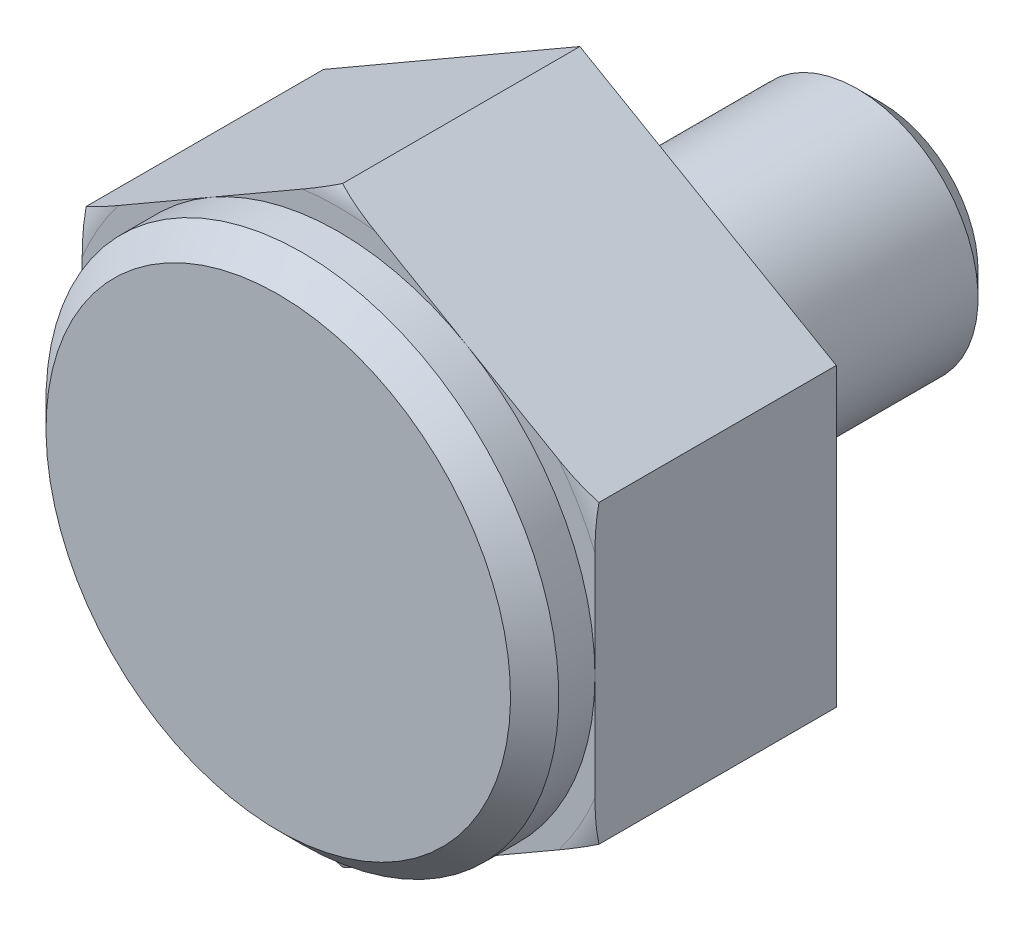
ISO-10303-21;
HEADER;
FILE_DESCRIPTION(('STEP AP214'),'2;1');
FILE_NAME('part.step','',(''),(''),'','','');
FILE_SCHEMA(('AUTOMOTIVE_DESIGN { 1 0 10303 214 1 1 1 1 }'));
ENDSEC;
DATA;
#1=APPLICATION_CONTEXT('core data for automotive mechanical design processes');
#2=APPLICATION_PROTOCOL_DEFINITION('international standard','automotive_design',2000,#1);
#3=PRODUCT_CONTEXT('',#1,'mechanical');
#4=PRODUCT('Part','Part','',(#3));
#5=PRODUCT_RELATED_PRODUCT_CATEGORY('part','',(#4));
#6=PRODUCT_DEFINITION_FORMATION('','',#4);
#7=PRODUCT_DEFINITION_CONTEXT('part definition',#1,'design');
#8=PRODUCT_DEFINITION('design','',#6,#7);
#9=PRODUCT_DEFINITION_SHAPE('','',#8);
#10=(LENGTH_UNIT() NAMED_UNIT(*) SI_UNIT(.MILLI.,.METRE.));
#11=(NAMED_UNIT(*) PLANE_ANGLE_UNIT() SI_UNIT($,.RADIAN.));
#12=(NAMED_UNIT(*) SI_UNIT($,.STERADIAN.) SOLID_ANGLE_UNIT());
#13=UNCERTAINTY_MEASURE_WITH_UNIT(LENGTH_MEASURE(1.E-05),#10,'distance_accuracy_value','');
#14=(GEOMETRIC_REPRESENTATION_CONTEXT(3) GLOBAL_UNCERTAINTY_ASSIGNED_CONTEXT((#13)) GLOBAL_UNIT_ASSIGNED_CONTEXT((#10,
#11,#12)) REPRESENTATION_CONTEXT('',''));
#15=CARTESIAN_POINT('',(0.,0.,0.));
#16=DIRECTION('',(0.,0.,1.));
#17=DIRECTION('',(1.,0.,0.));
#18=AXIS2_PLACEMENT_3D('',#15,#16,#17);
#19=CARTESIAN_POINT('',(10.7,0.,0.));
#20=DIRECTION('',(0.,0.,-1.));
#21=DIRECTION('',(0.,1.,0.));
#22=AXIS2_PLACEMENT_3D('',#19,#20,#21);
#23=PLANE('',#22);
#24=CARTESIAN_POINT('',(0.,0.,0.));
#25=DIRECTION('',(0.,0.,-1.));
#26=DIRECTION('',(0.,1.,0.));
#27=AXIS2_PLACEMENT_3D('',#24,#25,#26);
#28=CIRCLE('',#27,3.2);
#29=CARTESIAN_POINT('',(0.,3.2,0.));
#30=VERTEX_POINT('',#29);
#31=EDGE_CURVE('E175',#30,#30,#28,.T.);
#32=ORIENTED_EDGE('',*,*,#31,.F.);
#33=EDGE_LOOP('',(#32));
#34=FACE_BOUND('',#33,.T.);
#35=DIRECTION('',(0.,1.,0.));
#36=VECTOR('',#35,1.);
#37=CARTESIAN_POINT('',(-8.5,0.,0.));
#38=LINE('',#37,#36);
#39=CARTESIAN_POINT('',(-8.5,-4.9074772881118,0.));
#40=VERTEX_POINT('',#39);
#41=CARTESIAN_POINT('',(-8.5,4.9074772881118,0.));
#42=VERTEX_POINT('',#41);
#43=EDGE_CURVE('E192',#40,#42,#38,.T.);
#44=ORIENTED_EDGE('',*,*,#43,.T.);
#45=DIRECTION('',(0.86602540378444,0.5,0.));
#46=VECTOR('',#45,1.);
#47=CARTESIAN_POINT('',(3.775,11.9944518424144,0.));
#48=LINE('',#47,#46);
#49=CARTESIAN_POINT('',(0.,9.8149545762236,0.));
#50=VERTEX_POINT('',#49);
#51=EDGE_CURVE('E9',#42,#50,#48,.T.);
#52=ORIENTED_EDGE('',*,*,#51,.T.);
#53=DIRECTION('',(0.86602540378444,-0.5,0.));
#54=VECTOR('',#53,1.);
#55=CARTESIAN_POINT('',(12.275,2.72798002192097,0.));
#56=LINE('',#55,#54);
#57=CARTESIAN_POINT('',(8.5,4.9074772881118,0.));
#58=VERTEX_POINT('',#57);
#59=EDGE_CURVE('E22',#50,#58,#56,.T.);
#60=ORIENTED_EDGE('',*,*,#59,.T.);
#61=DIRECTION('',(0.,-1.,0.));
#62=VECTOR('',#61,1.);
#63=CARTESIAN_POINT('',(8.5,0.,0.));
#64=LINE('',#63,#62);
#65=CARTESIAN_POINT('',(8.5,-4.9074772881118,0.));
#66=VERTEX_POINT('',#65);
#67=EDGE_CURVE('E200',#58,#66,#64,.T.);
#68=ORIENTED_EDGE('',*,*,#67,.T.);
#69=DIRECTION('',(-0.86602540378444,-0.5,0.));
#70=VECTOR('',#69,1.);
#71=CARTESIAN_POINT('',(12.275,-2.72798002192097,0.));
#72=LINE('',#71,#70);
#73=CARTESIAN_POINT('',(0.,-9.8149545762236,0.));
#74=VERTEX_POINT('',#73);
#75=EDGE_CURVE('E197',#66,#74,#72,.T.);
#76=ORIENTED_EDGE('',*,*,#75,.T.);
#77=DIRECTION('',(-0.86602540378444,0.5,0.));
#78=VECTOR('',#77,1.);
#79=CARTESIAN_POINT('',(3.775,-11.9944518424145,0.));
#80=LINE('',#79,#78);
#81=EDGE_CURVE('E194',#74,#40,#80,.T.);
#82=ORIENTED_EDGE('',*,*,#81,.T.);
#83=EDGE_LOOP('',(#44,#52,#60,#68,#76,#82));
#84=FACE_BOUND('',#83,.T.);
#85=ADVANCED_FACE('F14',(#34,#84),#23,.T.);
#86=CARTESIAN_POINT('',(0.,0.,-10.));
#87=DIRECTION('',(0.,0.,-1.));
#88=DIRECTION('',(0.,1.,0.));
#89=AXIS2_PLACEMENT_3D('',#86,#87,#88);
#90=CYLINDRICAL_SURFACE('',#89,3.2);
#91=ORIENTED_EDGE('',*,*,#31,.T.);
#92=EDGE_LOOP('',(#91));
#93=FACE_BOUND('',#92,.T.);
#94=CARTESIAN_POINT('',(0.,0.,-1.25));
#95=DIRECTION('',(0.,0.,-1.));
#96=DIRECTION('',(0.,1.,0.));
#97=AXIS2_PLACEMENT_3D('',#94,#95,#96);
#98=CIRCLE('',#97,3.2);
#99=CARTESIAN_POINT('',(0.,3.2,-1.25));
#100=VERTEX_POINT('',#99);
#101=EDGE_CURVE('E172',#100,#100,#98,.T.);
#102=ORIENTED_EDGE('',*,*,#101,.F.);
#103=EDGE_LOOP('',(#102));
#104=FACE_BOUND('',#103,.T.);
#105=ADVANCED_FACE('F254',(#93,#104),#90,.T.);
#106=CARTESIAN_POINT('',(0.,0.,-2.05));
#107=DIRECTION('',(0.,0.,-1.));
#108=DIRECTION('',(0.,1.,0.));
#109=AXIS2_PLACEMENT_3D('',#106,#107,#108);
#110=CONICAL_SURFACE('',#109,4.,0.785398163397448);
#111=ORIENTED_EDGE('',*,*,#101,.T.);
#112=EDGE_LOOP('',(#111));
#113=FACE_BOUND('',#112,.T.);
#114=CARTESIAN_POINT('',(0.,0.,-2.05));
#115=DIRECTION('',(0.,0.,-1.));
#116=DIRECTION('',(0.,1.,0.));
#117=AXIS2_PLACEMENT_3D('',#114,#115,#116);
#118=CIRCLE('',#117,4.);
#119=CARTESIAN_POINT('',(0.,4.,-2.05));
#120=VERTEX_POINT('',#119);
#121=EDGE_CURVE('E169',#120,#120,#118,.T.);
#122=ORIENTED_EDGE('',*,*,#121,.F.);
#123=EDGE_LOOP('',(#122));
#124=FACE_BOUND('',#123,.T.);
#125=ADVANCED_FACE('F250',(#113,#124),#110,.T.);
#126=CARTESIAN_POINT('',(0.,0.,-10.));
#127=DIRECTION('',(0.,0.,-1.));
#128=DIRECTION('',(0.,1.,0.));
#129=AXIS2_PLACEMENT_3D('',#126,#127,#128);
#130=CYLINDRICAL_SURFACE('',#129,4.);
#131=ORIENTED_EDGE('',*,*,#121,.T.);
#132=EDGE_LOOP('',(#131));
#133=FACE_BOUND('',#132,.T.);
#134=CARTESIAN_POINT('',(0.,0.,-9.2));
#135=DIRECTION('',(0.,0.,-1.));
#136=DIRECTION('',(0.,1.,0.));
#137=AXIS2_PLACEMENT_3D('',#134,#135,#136);
#138=CIRCLE('',#137,4.);
#139=CARTESIAN_POINT('',(0.,4.,-9.2));
#140=VERTEX_POINT('',#139);
#141=EDGE_CURVE('E160',#140,#140,#138,.T.);
#142=ORIENTED_EDGE('',*,*,#141,.F.);
#143=EDGE_LOOP('',(#142));
#144=FACE_BOUND('',#143,.T.);
#145=ADVANCED_FACE('F246',(#133,#144),#130,.T.);
#146=CARTESIAN_POINT('',(0.,0.,-10.));
#147=DIRECTION('',(0.,0.,1.));
#148=DIRECTION('',(0.,-1.,0.));
#149=AXIS2_PLACEMENT_3D('',#146,#147,#148);
#150=CONICAL_SURFACE('',#149,3.2,0.785398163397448);
#151=ORIENTED_EDGE('',*,*,#141,.T.);
#152=EDGE_LOOP('',(#151));
#153=FACE_BOUND('',#152,.T.);
#154=CARTESIAN_POINT('',(0.,0.,-10.));
#155=DIRECTION('',(0.,0.,-1.));
#156=DIRECTION('',(0.,1.,0.));
#157=AXIS2_PLACEMENT_3D('',#154,#155,#156);
#158=CIRCLE('',#157,3.2);
#159=CARTESIAN_POINT('',(0.,3.2,-10.));
#160=VERTEX_POINT('',#159);
#161=EDGE_CURVE('E154',#160,#160,#158,.T.);
#162=ORIENTED_EDGE('',*,*,#161,.F.);
#163=EDGE_LOOP('',(#162));
#164=FACE_BOUND('',#163,.T.);
#165=ADVANCED_FACE('F242',(#153,#164),#150,.T.);
#166=CARTESIAN_POINT('',(3.2,0.,-10.));
#167=DIRECTION('',(0.,0.,-1.));
#168=DIRECTION('',(0.,1.,0.));
#169=AXIS2_PLACEMENT_3D('',#166,#167,#168);
#170=PLANE('',#169);
#171=ORIENTED_EDGE('',*,*,#161,.T.);
#172=EDGE_LOOP('',(#171));
#173=FACE_BOUND('',#172,.T.);
#174=ADVANCED_FACE('F239',(#173),#170,.T.);
#175=CARTESIAN_POINT('',(0.,9.8149545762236,-3.));
#176=DIRECTION('',(-0.5,0.86602540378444,0.));
#177=DIRECTION('',(-0.86602540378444,-0.5,0.));
#178=AXIS2_PLACEMENT_3D('',#175,#176,#177);
#179=PLANE('',#178);
#180=DIRECTION('',(0.,0.,1.));
#181=VECTOR('',#180,1.);
#182=CARTESIAN_POINT('',(0.,9.8149545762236,-3.));
#183=LINE('',#182,#181);
#184=CARTESIAN_POINT('',(0.,9.8149545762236,7.8681487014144));
#185=VERTEX_POINT('',#184);
#186=EDGE_CURVE('E123',#50,#185,#183,.T.);
#187=ORIENTED_EDGE('',*,*,#186,.F.);
#188=ORIENTED_EDGE('',*,*,#51,.F.);
#189=DIRECTION('',(0.,0.,1.));
#190=VECTOR('',#189,1.);
#191=CARTESIAN_POINT('',(-8.5,4.9074772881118,-3.));
#192=LINE('',#191,#190);
#193=CARTESIAN_POINT('',(-8.5,4.9074772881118,7.86814870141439));
#194=VERTEX_POINT('',#193);
#195=EDGE_CURVE('E35',#42,#194,#192,.T.);
#196=ORIENTED_EDGE('',*,*,#195,.T.);
#197=CARTESIAN_POINT('',(0.00020000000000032,9.81507004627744,7.86809679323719));
#198=CARTESIAN_POINT('',(-0.0775698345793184,9.77016961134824,7.88825648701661));
#199=CARTESIAN_POINT('',(-0.155854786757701,9.72497177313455,7.90553419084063));
#200=CARTESIAN_POINT('',(-0.313062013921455,9.634208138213,7.93507292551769));
#201=CARTESIAN_POINT('',(-0.391983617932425,9.58864272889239,7.94733867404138));
#202=CARTESIAN_POINT('',(-0.549704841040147,9.49758233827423,7.96756999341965));
#203=CARTESIAN_POINT('',(-0.628501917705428,9.45208882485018,7.9755630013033));
#204=CARTESIAN_POINT('',(-0.786320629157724,9.36097214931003,7.98799403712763));
#205=CARTESIAN_POINT('',(-0.86534231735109,9.31534895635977,7.9924311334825));
#206=CARTESIAN_POINT('',(-1.10235679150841,9.1785085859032,8.00125982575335));
#207=CARTESIAN_POINT('',(-1.26047132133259,9.08722111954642,8.0011882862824));
#208=CARTESIAN_POINT('',(-1.57679389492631,8.90459219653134,7.99304974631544));
#209=CARTESIAN_POINT('',(-1.73500150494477,8.81325099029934,7.98496692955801));
#210=CARTESIAN_POINT('',(-2.03092902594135,8.64239715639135,7.96553744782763));
#211=CARTESIAN_POINT('',(-2.16867819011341,8.56286763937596,7.95474127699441));
#212=CARTESIAN_POINT('',(-2.4440904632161,8.40385828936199,7.9317511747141));
#213=CARTESIAN_POINT('',(-2.58175356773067,8.32437845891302,7.91955717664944));
#214=CARTESIAN_POINT('',(-2.85708883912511,8.16541356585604,7.89573210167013));
#215=CARTESIAN_POINT('',(-2.99476099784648,8.08592850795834,7.88410090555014));
#216=CARTESIAN_POINT('',(-3.27023749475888,7.92688207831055,7.86315849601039));
#217=CARTESIAN_POINT('',(-3.4080418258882,7.84732071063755,7.85384716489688));
#218=CARTESIAN_POINT('',(-3.68383488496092,7.68809151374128,7.83895919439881));
#219=CARTESIAN_POINT('',(-3.82182364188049,7.60842366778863,7.83338323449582));
#220=CARTESIAN_POINT('',(-4.09788366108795,7.4490403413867,7.82683982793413));
#221=CARTESIAN_POINT('',(-4.23595492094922,7.36932486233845,7.82587225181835));
#222=CARTESIAN_POINT('',(-4.51214359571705,7.20986725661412,7.8286997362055));
#223=CARTESIAN_POINT('',(-4.65026098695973,7.13012514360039,7.83249771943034));
#224=CARTESIAN_POINT('',(-4.92636371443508,6.97071715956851,7.84426255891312));
#225=CARTESIAN_POINT('',(-5.06434904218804,6.89105129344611,7.85222966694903));
#226=CARTESIAN_POINT('',(-5.33931193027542,6.73230139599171,7.87104817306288));
#227=CARTESIAN_POINT('',(-5.47629046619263,6.65321680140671,7.88188151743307));
#228=CARTESIAN_POINT('',(-5.75015519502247,6.49510092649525,7.90483625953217));
#229=CARTESIAN_POINT('',(-5.88704139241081,6.41606964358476,7.91695758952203));
#230=CARTESIAN_POINT('',(-6.16060306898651,6.25812873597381,7.94061012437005));
#231=CARTESIAN_POINT('',(-6.2972784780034,6.1792191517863,7.95214236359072));
#232=CARTESIAN_POINT('',(-6.57081963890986,6.02129008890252,7.97264810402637));
#233=CARTESIAN_POINT('',(-6.70768543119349,5.94227058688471,7.98162093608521));
#234=CARTESIAN_POINT('',(-6.98251753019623,5.78359620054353,7.99490862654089));
#235=CARTESIAN_POINT('',(-7.1204850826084,5.70394059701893,7.99919197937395));
#236=CARTESIAN_POINT('',(-7.39637766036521,5.54465394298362,8.00060287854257));
#237=CARTESIAN_POINT('',(-7.53430262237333,5.46502292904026,7.99773649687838));
#238=CARTESIAN_POINT('',(-7.74148255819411,5.34540753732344,7.98598520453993));
#239=CARTESIAN_POINT('',(-7.81089440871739,5.30533258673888,7.98078697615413));
#240=CARTESIAN_POINT('',(-7.949498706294,5.22530935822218,7.96746638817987));
#241=CARTESIAN_POINT('',(-8.01869119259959,5.18536105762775,7.95934458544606));
#242=CARTESIAN_POINT('',(-8.15693697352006,5.10554481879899,7.93970609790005));
#243=CARTESIAN_POINT('',(-8.22598920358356,5.06567749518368,7.92817915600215));
#244=CARTESIAN_POINT('',(-8.36356240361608,4.98624957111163,7.90120826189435));
#245=CARTESIAN_POINT('',(-8.43208297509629,4.94668920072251,7.88576161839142));
#246=CARTESIAN_POINT('',(-8.50019999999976,4.9073618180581,7.86809679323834));
#247=B_SPLINE_CURVE_WITH_KNOTS('',3,(#197,#198,#199,#200,#201,#202,#203,#204,#205,#206,#207,
#208,#209,#210,#211,#212,#213,#214,#215,#216,#217,#218,#219,#220,#221,#222,#223,#224,#225,#226,
#227,#228,#229,#230,#231,#232,#233,#234,#235,#236,#237,#238,#239,#240,#241,#242,#243,#244,#245,
#246),.UNSPECIFIED.,.F.,.F.,(4,2,2,2,2,2,2,2,2,2,2,2,2,2,2,2,2,2,2,2,2,2,2,2,4),(0.,
0.275987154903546,0.551713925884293,0.825648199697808,1.09965421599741,1.64706775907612,
2.19556419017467,2.67382297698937,3.15210456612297,3.63028440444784,4.1084399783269,
4.58668250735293,5.06491160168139,5.54343413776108,6.02198557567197,6.4975916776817,
6.9731727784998,7.44788789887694,7.92272701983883,8.40073706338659,8.87834128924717,
9.11925238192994,9.36011761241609,9.60171591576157,9.84348055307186),.UNSPECIFIED.);
#248=CARTESIAN_POINT('',(-7.29836021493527,5.60124434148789,8.));
#249=VERTEX_POINT('',#248);
#250=EDGE_CURVE('E129',#249,#194,#247,.T.);
#251=ORIENTED_EDGE('',*,*,#250,.F.);
#252=DIRECTION('',(-0.86602540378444,-0.5,0.));
#253=VECTOR('',#252,1.);
#254=CARTESIAN_POINT('',(2.12500000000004,11.0418238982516,8.));
#255=LINE('',#254,#253);
#256=CARTESIAN_POINT('',(-4.25,7.36121593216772,8.));
#257=VERTEX_POINT('',#256);
#258=EDGE_CURVE('E136',#257,#249,#255,.T.);
#259=ORIENTED_EDGE('',*,*,#258,.F.);
#260=CARTESIAN_POINT('',(-1.20163978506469,9.12118752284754,8.));
#261=VERTEX_POINT('',#260);
#262=EDGE_CURVE('E140',#261,#257,#255,.T.);
#263=ORIENTED_EDGE('',*,*,#262,.F.);
#264=EDGE_CURVE('E139',#185,#261,#247,.T.);
#265=ORIENTED_EDGE('',*,*,#264,.F.);
#266=EDGE_LOOP('',(#187,#188,#196,#251,#259,#263,#265));
#267=FACE_BOUND('',#266,.T.);
#268=ADVANCED_FACE('F128',(#267),#179,.T.);
#269=CARTESIAN_POINT('',(8.5,4.9074772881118,-3.));
#270=DIRECTION('',(0.5,0.86602540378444,0.));
#271=DIRECTION('',(-0.86602540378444,0.5,0.));
#272=AXIS2_PLACEMENT_3D('',#269,#270,#271);
#273=PLANE('',#272);
#274=DIRECTION('',(0.,0.,1.));
#275=VECTOR('',#274,1.);
#276=CARTESIAN_POINT('',(8.5,4.9074772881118,-3.));
#277=LINE('',#276,#275);
#278=CARTESIAN_POINT('',(8.5,4.9074772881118,7.86814870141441));
#279=VERTEX_POINT('',#278);
#280=EDGE_CURVE('E209',#58,#279,#277,.T.);
#281=ORIENTED_EDGE('',*,*,#280,.F.);
#282=ORIENTED_EDGE('',*,*,#59,.F.);
#283=ORIENTED_EDGE('',*,*,#186,.T.);
#284=CARTESIAN_POINT('',(8.50019999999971,4.90736181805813,7.86809679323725));
#285=CARTESIAN_POINT('',(8.42243016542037,4.95226225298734,7.88825648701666));
#286=CARTESIAN_POINT('',(8.34414521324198,4.99746009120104,7.90553419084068));
#287=CARTESIAN_POINT('',(8.1869379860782,5.0882237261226,7.93507292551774));
#288=CARTESIAN_POINT('',(8.10801638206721,5.13378913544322,7.94733867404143));
#289=CARTESIAN_POINT('',(7.95029515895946,5.2248495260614,7.96756999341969));
#290=CARTESIAN_POINT('',(7.87149808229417,5.27034303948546,7.97556300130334));
#291=CARTESIAN_POINT('',(7.71367937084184,5.36145971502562,7.98799403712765));
#292=CARTESIAN_POINT('',(7.63465768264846,5.40708290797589,7.99243113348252));
#293=CARTESIAN_POINT('',(7.3976432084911,5.54392327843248,8.00125982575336));
#294=CARTESIAN_POINT('',(7.23952867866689,5.63521074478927,8.00118828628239));
#295=CARTESIAN_POINT('',(6.92320610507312,5.8178396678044,7.99304974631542));
#296=CARTESIAN_POINT('',(6.76499849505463,5.90918087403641,7.98496692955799));
#297=CARTESIAN_POINT('',(6.46907097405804,6.08003470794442,7.9655374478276));
#298=CARTESIAN_POINT('',(6.33132180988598,6.1595642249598,7.95474127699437));
#299=CARTESIAN_POINT('',(6.0559095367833,6.31857357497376,7.93175117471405));
#300=CARTESIAN_POINT('',(5.91824643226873,6.39805340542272,7.91955717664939));
#301=CARTESIAN_POINT('',(5.64291116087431,6.55701829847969,7.89573210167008));
#302=CARTESIAN_POINT('',(5.50523900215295,6.63650335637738,7.8841009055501));
#303=CARTESIAN_POINT('',(5.22976250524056,6.79554978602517,7.86315849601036));
#304=CARTESIAN_POINT('',(5.09195817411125,6.87511115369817,7.85384716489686));
#305=CARTESIAN_POINT('',(4.81616511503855,7.03434035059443,7.83895919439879));
#306=CARTESIAN_POINT('',(4.67817635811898,7.11400819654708,7.83338323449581));
#307=CARTESIAN_POINT('',(4.40211633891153,7.27339152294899,7.82683982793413));
#308=CARTESIAN_POINT('',(4.26404507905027,7.35310700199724,7.82587225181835));
#309=CARTESIAN_POINT('',(3.98785640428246,7.51256460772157,7.82869973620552));
#310=CARTESIAN_POINT('',(3.84973901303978,7.59230672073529,7.83249771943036));
#311=CARTESIAN_POINT('',(3.57363628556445,7.75171470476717,7.84426255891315));
#312=CARTESIAN_POINT('',(3.43565095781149,7.83138057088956,7.85222966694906));
#313=CARTESIAN_POINT('',(3.16068806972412,7.99013046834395,7.87104817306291));
#314=CARTESIAN_POINT('',(3.02370953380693,8.06921506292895,7.88188151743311));
#315=CARTESIAN_POINT('',(2.74984480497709,8.2273309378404,7.90483625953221));
#316=CARTESIAN_POINT('',(2.61295860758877,8.30636222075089,7.91695758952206));
#317=CARTESIAN_POINT('',(2.33939693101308,8.46430312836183,7.94061012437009));
#318=CARTESIAN_POINT('',(2.20272152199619,8.54321271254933,7.95214236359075));
#319=CARTESIAN_POINT('',(1.92918036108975,8.70114177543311,7.97264810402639));
#320=CARTESIAN_POINT('',(1.79231456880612,8.78016127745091,7.98162093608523));
#321=CARTESIAN_POINT('',(1.5174824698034,8.93883566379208,7.9949086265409));
#322=CARTESIAN_POINT('',(1.37951491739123,9.01849126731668,7.99919197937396));
#323=CARTESIAN_POINT('',(1.10362233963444,9.17777792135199,8.00060287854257));
#324=CARTESIAN_POINT('',(0.965697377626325,9.25740893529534,7.99773649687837));
#325=CARTESIAN_POINT('',(0.758517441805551,9.37702432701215,7.98598520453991));
#326=CARTESIAN_POINT('',(0.689105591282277,9.41709927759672,7.98078697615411));
#327=CARTESIAN_POINT('',(0.550501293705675,9.4971225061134,7.96746638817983));
#328=CARTESIAN_POINT('',(0.481308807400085,9.53707080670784,7.95934458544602));
#329=CARTESIAN_POINT('',(0.343063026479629,9.61688704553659,7.93970609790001));
#330=CARTESIAN_POINT('',(0.274010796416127,9.6567543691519,7.9281791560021));
#331=CARTESIAN_POINT('',(0.136437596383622,9.73618229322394,7.90120826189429));
#332=CARTESIAN_POINT('',(0.0679170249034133,9.77574266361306,7.88576161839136));
#333=CARTESIAN_POINT('',(-0.000200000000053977,9.81507004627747,7.86809679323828));
#334=B_SPLINE_CURVE_WITH_KNOTS('',3,(#284,#285,#286,#287,#288,#289,#290,#291,#292,#293,#294,
#295,#296,#297,#298,#299,#300,#301,#302,#303,#304,#305,#306,#307,#308,#309,#310,#311,#312,#313,
#314,#315,#316,#317,#318,#319,#320,#321,#322,#323,#324,#325,#326,#327,#328,#329,#330,#331,#332,
#333),.UNSPECIFIED.,.F.,.F.,(4,2,2,2,2,2,2,2,2,2,2,2,2,2,2,2,2,2,2,2,2,2,2,2,4),(0.,
0.275987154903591,0.551713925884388,0.825648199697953,1.0996542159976,1.6470677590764,
2.19556419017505,2.67382297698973,3.1521045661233,3.63028440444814,4.10843997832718,
4.58668250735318,5.06491160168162,5.54343413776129,6.02198557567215,6.49759167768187,
6.97317277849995,7.44788789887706,7.92272701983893,8.40073706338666,8.87834128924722,
9.11925238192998,9.36011761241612,9.60171591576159,9.84348055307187),.UNSPECIFIED.);
#335=CARTESIAN_POINT('',(1.20163978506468,9.12118752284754,8.));
#336=VERTEX_POINT('',#335);
#337=EDGE_CURVE('E145',#336,#185,#334,.T.);
#338=ORIENTED_EDGE('',*,*,#337,.F.);
#339=DIRECTION('',(-0.86602540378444,0.5,0.));
#340=VECTOR('',#339,1.);
#341=CARTESIAN_POINT('',(10.625,3.68060796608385,8.));
#342=LINE('',#341,#340);
#343=CARTESIAN_POINT('',(4.25,7.36121593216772,8.));
#344=VERTEX_POINT('',#343);
#345=EDGE_CURVE('E491',#344,#336,#342,.T.);
#346=ORIENTED_EDGE('',*,*,#345,.F.);
#347=CARTESIAN_POINT('',(7.29836021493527,5.60124434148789,8.));
#348=VERTEX_POINT('',#347);
#349=EDGE_CURVE('E143',#348,#344,#342,.T.);
#350=ORIENTED_EDGE('',*,*,#349,.F.);
#351=EDGE_CURVE('E137',#279,#348,#334,.T.);
#352=ORIENTED_EDGE('',*,*,#351,.F.);
#353=EDGE_LOOP('',(#281,#282,#283,#338,#346,#350,#352));
#354=FACE_BOUND('',#353,.T.);
#355=ADVANCED_FACE('F207',(#354),#273,.T.);
#356=CARTESIAN_POINT('',(8.5,-4.9074772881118,-3.));
#357=DIRECTION('',(1.,0.,0.));
#358=DIRECTION('',(0.,1.,0.));
#359=AXIS2_PLACEMENT_3D('',#356,#357,#358);
#360=PLANE('',#359);
#361=DIRECTION('',(0.,1.,0.));
#362=VECTOR('',#361,1.);
#363=CARTESIAN_POINT('',(8.5,0.,8.));
#364=LINE('',#363,#362);
#365=CARTESIAN_POINT('',(8.5,-3.51994318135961,8.));
#366=VERTEX_POINT('',#365);
#367=CARTESIAN_POINT('',(8.5,0.,8.));
#368=VERTEX_POINT('',#367);
#369=EDGE_CURVE('E496',#366,#368,#364,.T.);
#370=ORIENTED_EDGE('',*,*,#369,.F.);
#371=CARTESIAN_POINT('',(8.5,0.,7.82664991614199));
#372=CARTESIAN_POINT('',(8.5,0.125047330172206,7.8266437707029));
#373=CARTESIAN_POINT('',(8.5,0.25009242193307,7.8281163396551));
#374=CARTESIAN_POINT('',(8.5,0.50011954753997,7.8338478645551));
#375=CARTESIAN_POINT('',(8.5,0.625101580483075,7.83810685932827));
#376=CARTESIAN_POINT('',(8.5,0.875005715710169,7.84901012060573));
#377=CARTESIAN_POINT('',(8.5,0.99992777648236,7.85565530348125));
#378=CARTESIAN_POINT('',(8.5,1.24966826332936,7.87069589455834));
#379=CARTESIAN_POINT('',(8.5,1.37448668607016,7.87909135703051));
#380=CARTESIAN_POINT('',(8.5,1.74936920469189,7.90578555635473));
#381=CARTESIAN_POINT('',(8.5,1.99931804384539,7.92556203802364));
#382=CARTESIAN_POINT('',(8.5,2.49942057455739,7.96166374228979));
#383=CARTESIAN_POINT('',(8.5,2.7495741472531,7.97799031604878));
#384=CARTESIAN_POINT('',(8.5,3.12557409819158,7.99363201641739));
#385=CARTESIAN_POINT('',(8.5,3.25121665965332,7.99737020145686));
#386=CARTESIAN_POINT('',(8.5,3.50255169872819,8.00070101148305));
#387=CARTESIAN_POINT('',(8.5,3.6282441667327,8.00029422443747));
#388=CARTESIAN_POINT('',(8.5,3.87949943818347,7.99405587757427));
#389=CARTESIAN_POINT('',(8.5,4.00506225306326,7.98822484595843));
#390=CARTESIAN_POINT('',(8.5,4.25567676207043,7.96968164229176));
#391=CARTESIAN_POINT('',(8.5,4.38072860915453,7.95697170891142));
#392=CARTESIAN_POINT('',(8.5,4.59320883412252,7.92793715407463));
#393=CARTESIAN_POINT('',(8.5,4.68092863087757,7.91376174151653));
#394=CARTESIAN_POINT('',(8.5,4.85540226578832,7.88039958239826));
#395=CARTESIAN_POINT('',(8.5,4.94215637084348,7.86121425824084));
#396=CARTESIAN_POINT('',(8.5,5.11404821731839,7.81704478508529));
#397=CARTESIAN_POINT('',(8.5,5.19918836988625,7.79207016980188));
#398=CARTESIAN_POINT('',(8.5,5.36715872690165,7.73536800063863));
#399=CARTESIAN_POINT('',(8.5,5.44999046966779,7.7036450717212));
#400=CARTESIAN_POINT('',(8.5,5.61941349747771,7.62918840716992));
#401=CARTESIAN_POINT('',(8.5,5.70569269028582,7.5857306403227));
#402=CARTESIAN_POINT('',(8.5,5.87192631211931,7.48789410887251));
#403=CARTESIAN_POINT('',(8.5,5.95188525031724,7.43352323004));
#404=CARTESIAN_POINT('',(8.5,6.08581680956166,7.32526828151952));
#405=CARTESIAN_POINT('',(8.5,6.14169180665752,7.27376139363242));
#406=CARTESIAN_POINT('',(8.5,6.24464781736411,7.16255824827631));
#407=CARTESIAN_POINT('',(8.5,6.29174362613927,7.10287606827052));
#408=CARTESIAN_POINT('',(8.5,6.36390910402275,6.99096584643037));
#409=CARTESIAN_POINT('',(8.5,6.39155175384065,6.94040608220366));
#410=CARTESIAN_POINT('',(8.5,6.43819940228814,6.83542090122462));
#411=CARTESIAN_POINT('',(8.5,6.45721080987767,6.7809983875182));
#412=CARTESIAN_POINT('',(8.5,6.48524460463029,6.66919939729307));
#413=CARTESIAN_POINT('',(8.5,6.49419819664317,6.61180535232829));
#414=CARTESIAN_POINT('',(8.5,6.50105152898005,6.49636199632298));
#415=CARTESIAN_POINT('',(8.5,6.49895516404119,6.43831292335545));
#416=CARTESIAN_POINT('',(8.5,6.48471377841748,6.32964308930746));
#417=CARTESIAN_POINT('',(8.5,6.47363571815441,6.27887729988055));
#418=CARTESIAN_POINT('',(8.5,6.44358285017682,6.17976047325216));
#419=CARTESIAN_POINT('',(8.5,6.4246054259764,6.13141024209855));
#420=CARTESIAN_POINT('',(8.5,6.37286476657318,6.02338022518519));
#421=CARTESIAN_POINT('',(8.5,6.3376470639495,5.96487838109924));
#422=CARTESIAN_POINT('',(8.5,6.2581978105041,5.85437045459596));
#423=CARTESIAN_POINT('',(8.5,6.21394958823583,5.80237667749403));
#424=CARTESIAN_POINT('',(8.5,6.09738498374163,5.68304391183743));
#425=CARTESIAN_POINT('',(8.5,6.02139388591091,5.61931678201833));
#426=CARTESIAN_POINT('',(8.5,5.86054997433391,5.50433638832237));
#427=CARTESIAN_POINT('',(8.5,5.77567843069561,5.45311028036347));
#428=CARTESIAN_POINT('',(8.5,5.61377586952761,5.36844249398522));
#429=CARTESIAN_POINT('',(8.5,5.53752226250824,5.33348010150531));
#430=CARTESIAN_POINT('',(8.5,5.38224383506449,5.27026437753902));
#431=CARTESIAN_POINT('',(8.5,5.30321682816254,5.24201648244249));
#432=CARTESIAN_POINT('',(8.5,5.14327407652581,5.19134193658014));
#433=CARTESIAN_POINT('',(8.5,5.06235685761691,5.16892000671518));
#434=CARTESIAN_POINT('',(8.5,4.89935774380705,5.12916054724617));
#435=CARTESIAN_POINT('',(8.5,4.81727661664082,5.11181981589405));
#436=CARTESIAN_POINT('',(8.5,4.57529845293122,5.06735741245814));
#437=CARTESIAN_POINT('',(8.5,4.41430000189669,5.04622005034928));
#438=CARTESIAN_POINT('',(8.5,4.09111681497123,5.01624392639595));
#439=CARTESIAN_POINT('',(8.5,3.92893094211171,5.00741911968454));
#440=CARTESIAN_POINT('',(8.5,3.60366363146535,4.99886559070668));
#441=CARTESIAN_POINT('',(8.5,3.44058134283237,4.99917616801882));
#442=CARTESIAN_POINT('',(8.5,3.1146561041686,5.00622418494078));
#443=CARTESIAN_POINT('',(8.5,2.95181308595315,5.01295913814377));
#444=CARTESIAN_POINT('',(8.5,2.62512766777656,5.0304671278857));
#445=CARTESIAN_POINT('',(8.5,2.46128702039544,5.04127030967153));
#446=CARTESIAN_POINT('',(8.5,2.13372641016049,5.06459909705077));
#447=CARTESIAN_POINT('',(8.5,1.97000645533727,5.07712480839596));
#448=CARTESIAN_POINT('',(8.5,1.64297146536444,5.10171113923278));
#449=CARTESIAN_POINT('',(8.5,1.47965652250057,5.11377291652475));
#450=CARTESIAN_POINT('',(8.5,1.15287121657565,5.13553883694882));
#451=CARTESIAN_POINT('',(8.5,0.989400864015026,5.14524312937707));
#452=CARTESIAN_POINT('',(8.5,0.665741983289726,5.1605758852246));
#453=CARTESIAN_POINT('',(8.5,0.505557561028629,5.16628660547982));
#454=CARTESIAN_POINT('',(8.5,0.185088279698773,5.17306143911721));
#455=CARTESIAN_POINT('',(8.5,0.0248034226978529,5.17412564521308));
#456=CARTESIAN_POINT('',(8.5,-0.29587375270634,5.17143540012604));
#457=CARTESIAN_POINT('',(8.5,-0.456266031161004,5.16767643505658));
#458=CARTESIAN_POINT('',(8.5,-0.776892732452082,5.15593176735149));
#459=CARTESIAN_POINT('',(8.5,-0.937127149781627,5.14794592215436));
#460=CARTESIAN_POINT('',(8.5,-1.25758599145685,5.12898028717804));
#461=CARTESIAN_POINT('',(8.5,-1.41781021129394,5.11799721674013));
#462=CARTESIAN_POINT('',(8.5,-1.73816473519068,5.0947223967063));
#463=CARTESIAN_POINT('',(8.5,-1.89829503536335,5.08243059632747));
#464=CARTESIAN_POINT('',(8.5,-2.21852763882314,5.05847826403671));
#465=CARTESIAN_POINT('',(8.5,-2.37862991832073,5.04681743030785));
#466=CARTESIAN_POINT('',(8.5,-2.69900275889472,5.02620861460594));
#467=CARTESIAN_POINT('',(8.5,-2.85927329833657,5.01726031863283));
#468=CARTESIAN_POINT('',(8.5,-3.1808827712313,5.00427790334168));
#469=CARTESIAN_POINT('',(8.5,-3.3422228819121,5.00026994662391));
#470=CARTESIAN_POINT('',(8.5,-3.66505319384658,4.99975589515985));
#471=CARTESIAN_POINT('',(8.5,-3.82654342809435,5.00325410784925));
#472=CARTESIAN_POINT('',(8.5,-4.14856635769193,5.02061828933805));
#473=CARTESIAN_POINT('',(8.5,-4.30910046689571,5.03445541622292));
#474=CARTESIAN_POINT('',(8.5,-4.6283519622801,5.07590028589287));
#475=CARTESIAN_POINT('',(8.5,-4.78707139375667,5.10349054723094));
#476=CARTESIAN_POINT('',(8.5,-5.02283306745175,5.15868677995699));
#477=CARTESIAN_POINT('',(8.5,-5.10145968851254,5.17954076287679));
#478=CARTESIAN_POINT('',(8.5,-5.25708187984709,5.22659372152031));
#479=CARTESIAN_POINT('',(8.5,-5.33407822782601,5.25279008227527));
#480=CARTESIAN_POINT('',(8.5,-5.48546792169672,5.31122585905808));
#481=CARTESIAN_POINT('',(8.5,-5.55986930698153,5.34344418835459));
#482=CARTESIAN_POINT('',(8.5,-5.70520821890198,5.41484646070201));
#483=CARTESIAN_POINT('',(8.5,-5.77614936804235,5.45402291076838));
#484=CARTESIAN_POINT('',(8.5,-5.9086639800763,5.53754003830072));
#485=CARTESIAN_POINT('',(8.5,-5.97054654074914,5.58138391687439));
#486=CARTESIAN_POINT('',(8.5,-6.08819372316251,5.67683708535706));
#487=CARTESIAN_POINT('',(8.5,-6.14395374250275,5.7284521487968));
#488=CARTESIAN_POINT('',(8.5,-6.24738381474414,5.84063885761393));
#489=CARTESIAN_POINT('',(8.5,-6.29493941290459,5.90131810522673));
#490=CARTESIAN_POINT('',(8.5,-6.37737944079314,6.03074614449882));
#491=CARTESIAN_POINT('',(8.5,-6.41230192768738,6.09946986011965));
#492=CARTESIAN_POINT('',(8.5,-6.45741080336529,6.22068714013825));
#493=CARTESIAN_POINT('',(8.5,-6.47191209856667,6.27158373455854));
#494=CARTESIAN_POINT('',(8.5,-6.49214767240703,6.37509805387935));
#495=CARTESIAN_POINT('',(8.5,-6.49788756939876,6.42771465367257));
#496=CARTESIAN_POINT('',(8.5,-6.50015521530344,6.53322493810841));
#497=CARTESIAN_POINT('',(8.5,-6.4966692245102,6.58611891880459));
#498=CARTESIAN_POINT('',(8.5,-6.48073543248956,6.69053485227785));
#499=CARTESIAN_POINT('',(8.5,-6.46828463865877,6.74205634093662));
#500=CARTESIAN_POINT('',(8.5,-6.43547348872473,6.84193886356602));
#501=CARTESIAN_POINT('',(8.5,-6.41518858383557,6.89032505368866));
#502=CARTESIAN_POINT('',(8.5,-6.36789906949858,6.98366096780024));
#503=CARTESIAN_POINT('',(8.5,-6.34089164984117,7.0286092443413));
#504=CARTESIAN_POINT('',(8.5,-6.26568501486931,7.13736821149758));
#505=CARTESIAN_POINT('',(8.5,-6.21381646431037,7.19864380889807));
#506=CARTESIAN_POINT('',(8.5,-6.10102119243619,7.31219280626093));
#507=CARTESIAN_POINT('',(8.5,-6.04007197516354,7.36444313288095));
#508=CARTESIAN_POINT('',(8.5,-5.87621595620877,7.48740372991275));
#509=CARTESIAN_POINT('',(8.5,-5.76886799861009,7.55215528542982));
#510=CARTESIAN_POINT('',(8.5,-5.54579886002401,7.66485151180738));
#511=CARTESIAN_POINT('',(8.5,-5.43005994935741,7.71275926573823));
#512=CARTESIAN_POINT('',(8.5,-5.20255386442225,7.79192078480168));
#513=CARTESIAN_POINT('',(8.5,-5.09111165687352,7.8241335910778));
#514=CARTESIAN_POINT('',(8.5,-4.86584173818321,7.87894579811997));
#515=CARTESIAN_POINT('',(8.5,-4.75201192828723,7.90153633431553));
#516=CARTESIAN_POINT('',(8.5,-4.52291113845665,7.93883857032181));
#517=CARTESIAN_POINT('',(8.5,-4.40763805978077,7.95353697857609));
#518=CARTESIAN_POINT('',(8.5,-4.17651270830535,7.97644600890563));
#519=CARTESIAN_POINT('',(8.5,-4.06066063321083,7.98465871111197));
#520=CARTESIAN_POINT('',(8.5,-3.81083580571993,7.9967080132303));
#521=CARTESIAN_POINT('',(8.5,-3.67682360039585,7.99967451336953));
#522=CARTESIAN_POINT('',(8.5,-3.40878977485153,8.00027418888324));
#523=CARTESIAN_POINT('',(8.5,-3.27476815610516,7.99790658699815));
#524=CARTESIAN_POINT('',(8.5,-2.87309197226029,7.9850297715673));
#525=CARTESIAN_POINT('',(8.5,-2.60564928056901,7.96875103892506));
#526=CARTESIAN_POINT('',(8.5,-2.14352751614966,7.93625617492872));
#527=CARTESIAN_POINT('',(8.5,-1.94874188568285,7.92121509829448));
#528=CARTESIAN_POINT('',(8.5,-1.5590727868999,7.89205916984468));
#529=CARTESIAN_POINT('',(8.5,-1.36418931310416,7.87794437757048));
#530=CARTESIAN_POINT('',(8.5,-0.974519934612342,7.8538473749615));
#531=CARTESIAN_POINT('',(8.5,-0.779734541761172,7.84385740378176));
#532=CARTESIAN_POINT('',(8.5,-0.389964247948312,7.83026419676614));
#533=CARTESIAN_POINT('',(8.5,-0.194979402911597,7.82665949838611));
#534=CARTESIAN_POINT('',(8.5,0.,7.82664991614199));
#535=B_SPLINE_CURVE_WITH_KNOTS('',3,(#371,#372,#373,#374,#375,#376,#377,#378,#379,#380,#381,
#382,#383,#384,#385,#386,#387,#388,#389,#390,#391,#392,#393,#394,#395,#396,#397,#398,#399,#400,
#401,#402,#403,#404,#405,#406,#407,#408,#409,#410,#411,#412,#413,#414,#415,#416,#417,#418,#419,
#420,#421,#422,#423,#424,#425,#426,#427,#428,#429,#430,#431,#432,#433,#434,#435,#436,#437,#438,
#439,#440,#441,#442,#443,#444,#445,#446,#447,#448,#449,#450,#451,#452,#453,#454,#455,#456,#457,
#458,#459,#460,#461,#462,#463,#464,#465,#466,#467,#468,#469,#470,#471,#472,#473,#474,#475,#476,
#477,#478,#479,#480,#481,#482,#483,#484,#485,#486,#487,#488,#489,#490,#491,#492,#493,#494,#495,
#496,#497,#498,#499,#500,#501,#502,#503,#504,#505,#506,#507,#508,#509,#510,#511,#512,#513,#514,
#515,#516,#517,#518,#519,#520,#521,#522,#523,#524,#525,#526,#527,#528,#529,#530,#531,#532,#533,
#534),.UNSPECIFIED.,.T.,.F.,(4,2,2,2,2,2,2,2,2,2,2,2,2,2,2,2,2,2,2,2,2,2,2,2,2,2,2,2,2,2,2,2,2,
2,2,2,2,2,2,2,2,2,2,2,2,2,2,2,2,2,2,2,2,2,2,2,2,2,2,2,2,2,2,2,2,2,2,2,2,2,2,2,2,2,2,2,2,2,2,2,2,
4),(0.,0.375130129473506,0.750265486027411,1.12554506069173,1.50083627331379,2.25304835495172,
3.00496528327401,3.38200818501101,3.75899760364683,4.1359503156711,4.51278042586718,
4.77923439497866,5.0456127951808,5.31155560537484,5.57731673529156,5.86650123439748,
6.1554775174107,6.38272217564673,6.60958033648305,6.78178352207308,6.95385863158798,
7.1271036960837,7.30028770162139,7.45547335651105,7.61071045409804,7.81443221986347,
8.01853353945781,8.31440554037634,8.61091465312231,8.86221768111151,9.11372348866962,
9.36543246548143,9.61698249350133,10.1033958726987,10.5903601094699,11.0794195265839,
11.5682897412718,12.0608560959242,12.5534527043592,13.0447275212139,13.5359712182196,
14.0167722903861,14.4975637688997,14.9788055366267,15.4600635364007,15.9418504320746,
16.4236560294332,16.905229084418,17.3867463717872,17.8708028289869,18.3551371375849,
18.8381253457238,19.3205011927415,19.5643851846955,19.8081500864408,20.0510768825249,
20.2937436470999,20.5207412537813,20.7479083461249,20.9780253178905,21.2074431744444,
21.3655335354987,21.5235224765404,21.681746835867,21.8400240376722,21.9968134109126,
22.1536684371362,22.3931428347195,22.6332206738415,23.0072046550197,23.3820032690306,
23.7294958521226,24.077307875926,24.4257038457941,24.7739880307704,25.1759789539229,
25.5780284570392,26.3815979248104,26.9677219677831,27.5538836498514,28.1389373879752,
28.7238571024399),.UNSPECIFIED.);
#536=CARTESIAN_POINT('',(8.5,-4.9074772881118,7.86814870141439));
#537=VERTEX_POINT('',#536);
#538=EDGE_CURVE('E505',#537,#366,#535,.T.);
#539=ORIENTED_EDGE('',*,*,#538,.F.);
#540=DIRECTION('',(0.,0.,1.));
#541=VECTOR('',#540,1.);
#542=CARTESIAN_POINT('',(8.5,-4.9074772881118,-3.));
#543=LINE('',#542,#541);
#544=EDGE_CURVE('E211',#66,#537,#543,.T.);
#545=ORIENTED_EDGE('',*,*,#544,.F.);
#546=ORIENTED_EDGE('',*,*,#67,.F.);
#547=ORIENTED_EDGE('',*,*,#280,.T.);
#548=CARTESIAN_POINT('',(8.5,3.51994318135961,8.));
#549=VERTEX_POINT('',#548);
#550=EDGE_CURVE('E494',#549,#279,#535,.T.);
#551=ORIENTED_EDGE('',*,*,#550,.F.);
#552=EDGE_CURVE('E492',#368,#549,#364,.T.);
#553=ORIENTED_EDGE('',*,*,#552,.F.);
#554=EDGE_LOOP('',(#370,#539,#545,#546,#547,#551,#553));
#555=FACE_BOUND('',#554,.T.);
#556=ADVANCED_FACE('F311',(#555),#360,.T.);
#557=CARTESIAN_POINT('',(0.,-9.8149545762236,-3.));
#558=DIRECTION('',(0.5,-0.86602540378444,0.));
#559=DIRECTION('',(0.86602540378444,0.5,0.));
#560=AXIS2_PLACEMENT_3D('',#557,#558,#559);
#561=PLANE('',#560);
#562=DIRECTION('',(0.,0.,1.));
#563=VECTOR('',#562,1.);
#564=CARTESIAN_POINT('',(0.,-9.8149545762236,-3.));
#565=LINE('',#564,#563);
#566=CARTESIAN_POINT('',(0.,-9.8149545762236,7.8681487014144));
#567=VERTEX_POINT('',#566);
#568=EDGE_CURVE('E216',#74,#567,#565,.T.);
#569=ORIENTED_EDGE('',*,*,#568,.F.);
#570=ORIENTED_EDGE('',*,*,#75,.F.);
#571=ORIENTED_EDGE('',*,*,#544,.T.);
#572=CARTESIAN_POINT('',(-0.00020000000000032,-9.81507004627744,7.86809679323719));
#573=CARTESIAN_POINT('',(0.0775698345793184,-9.77016961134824,7.88825648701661));
#574=CARTESIAN_POINT('',(0.155854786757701,-9.72497177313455,7.90553419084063));
#575=CARTESIAN_POINT('',(0.313062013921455,-9.634208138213,7.93507292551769));
#576=CARTESIAN_POINT('',(0.391983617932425,-9.58864272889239,7.94733867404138));
#577=CARTESIAN_POINT('',(0.549704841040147,-9.49758233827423,7.96756999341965));
#578=CARTESIAN_POINT('',(0.628501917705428,-9.45208882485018,7.9755630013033));
#579=CARTESIAN_POINT('',(0.786320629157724,-9.36097214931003,7.98799403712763));
#580=CARTESIAN_POINT('',(0.86534231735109,-9.31534895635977,7.9924311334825));
#581=CARTESIAN_POINT('',(1.10235679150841,-9.1785085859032,8.00125982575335));
#582=CARTESIAN_POINT('',(1.26047132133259,-9.08722111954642,8.0011882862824));
#583=CARTESIAN_POINT('',(1.57679389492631,-8.90459219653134,7.99304974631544));
#584=CARTESIAN_POINT('',(1.73500150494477,-8.81325099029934,7.98496692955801));
#585=CARTESIAN_POINT('',(2.03092902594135,-8.64239715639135,7.96553744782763));
#586=CARTESIAN_POINT('',(2.16867819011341,-8.56286763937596,7.95474127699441));
#587=CARTESIAN_POINT('',(2.4440904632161,-8.40385828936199,7.9317511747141));
#588=CARTESIAN_POINT('',(2.58175356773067,-8.32437845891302,7.91955717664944));
#589=CARTESIAN_POINT('',(2.85708883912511,-8.16541356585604,7.89573210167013));
#590=CARTESIAN_POINT('',(2.99476099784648,-8.08592850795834,7.88410090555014));
#591=CARTESIAN_POINT('',(3.27023749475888,-7.92688207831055,7.86315849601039));
#592=CARTESIAN_POINT('',(3.4080418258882,-7.84732071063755,7.85384716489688));
#593=CARTESIAN_POINT('',(3.68383488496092,-7.68809151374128,7.83895919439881));
#594=CARTESIAN_POINT('',(3.82182364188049,-7.60842366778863,7.83338323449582));
#595=CARTESIAN_POINT('',(4.09788366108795,-7.4490403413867,7.82683982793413));
#596=CARTESIAN_POINT('',(4.23595492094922,-7.36932486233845,7.82587225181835));
#597=CARTESIAN_POINT('',(4.51214359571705,-7.20986725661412,7.8286997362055));
#598=CARTESIAN_POINT('',(4.65026098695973,-7.13012514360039,7.83249771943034));
#599=CARTESIAN_POINT('',(4.92636371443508,-6.97071715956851,7.84426255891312));
#600=CARTESIAN_POINT('',(5.06434904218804,-6.89105129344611,7.85222966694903));
#601=CARTESIAN_POINT('',(5.33931193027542,-6.73230139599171,7.87104817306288));
#602=CARTESIAN_POINT('',(5.47629046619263,-6.65321680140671,7.88188151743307));
#603=CARTESIAN_POINT('',(5.75015519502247,-6.49510092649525,7.90483625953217));
#604=CARTESIAN_POINT('',(5.88704139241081,-6.41606964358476,7.91695758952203));
#605=CARTESIAN_POINT('',(6.16060306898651,-6.25812873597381,7.94061012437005));
#606=CARTESIAN_POINT('',(6.2972784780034,-6.1792191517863,7.95214236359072));
#607=CARTESIAN_POINT('',(6.57081963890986,-6.02129008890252,7.97264810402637));
#608=CARTESIAN_POINT('',(6.70768543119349,-5.94227058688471,7.98162093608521));
#609=CARTESIAN_POINT('',(6.98251753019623,-5.78359620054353,7.99490862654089));
#610=CARTESIAN_POINT('',(7.1204850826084,-5.70394059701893,7.99919197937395));
#611=CARTESIAN_POINT('',(7.39637766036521,-5.54465394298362,8.00060287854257));
#612=CARTESIAN_POINT('',(7.53430262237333,-5.46502292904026,7.99773649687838));
#613=CARTESIAN_POINT('',(7.74148255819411,-5.34540753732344,7.98598520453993));
#614=CARTESIAN_POINT('',(7.81089440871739,-5.30533258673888,7.98078697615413));
#615=CARTESIAN_POINT('',(7.949498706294,-5.22530935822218,7.96746638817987));
#616=CARTESIAN_POINT('',(8.01869119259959,-5.18536105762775,7.95934458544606));
#617=CARTESIAN_POINT('',(8.15693697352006,-5.10554481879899,7.93970609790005));
#618=CARTESIAN_POINT('',(8.22598920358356,-5.06567749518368,7.92817915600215));
#619=CARTESIAN_POINT('',(8.36356240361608,-4.98624957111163,7.90120826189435));
#620=CARTESIAN_POINT('',(8.43208297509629,-4.94668920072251,7.88576161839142));
#621=CARTESIAN_POINT('',(8.50019999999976,-4.9073618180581,7.86809679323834));
#622=B_SPLINE_CURVE_WITH_KNOTS('',3,(#572,#573,#574,#575,#576,#577,#578,#579,#580,#581,#582,
#583,#584,#585,#586,#587,#588,#589,#590,#591,#592,#593,#594,#595,#596,#597,#598,#599,#600,#601,
#602,#603,#604,#605,#606,#607,#608,#609,#610,#611,#612,#613,#614,#615,#616,#617,#618,#619,#620,
#621),.UNSPECIFIED.,.F.,.F.,(4,2,2,2,2,2,2,2,2,2,2,2,2,2,2,2,2,2,2,2,2,2,2,2,4),(0.,
0.275987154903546,0.551713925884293,0.825648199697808,1.09965421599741,1.64706775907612,
2.19556419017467,2.67382297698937,3.15210456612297,3.63028440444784,4.1084399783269,
4.58668250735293,5.06491160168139,5.54343413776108,6.02198557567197,6.4975916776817,
6.9731727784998,7.44788789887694,7.92272701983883,8.40073706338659,8.87834128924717,
9.11925238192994,9.36011761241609,9.60171591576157,9.84348055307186),.UNSPECIFIED.);
#623=CARTESIAN_POINT('',(7.29836021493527,-5.60124434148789,8.));
#624=VERTEX_POINT('',#623);
#625=EDGE_CURVE('E516',#624,#537,#622,.T.);
#626=ORIENTED_EDGE('',*,*,#625,.F.);
#627=DIRECTION('',(0.86602540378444,0.5,0.));
#628=VECTOR('',#627,1.);
#629=CARTESIAN_POINT('',(10.625,-3.68060796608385,8.));
#630=LINE('',#629,#628);
#631=CARTESIAN_POINT('',(4.25,-7.36121593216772,8.));
#632=VERTEX_POINT('',#631);
#633=EDGE_CURVE('E512',#632,#624,#630,.T.);
#634=ORIENTED_EDGE('',*,*,#633,.F.);
#635=CARTESIAN_POINT('',(1.20163978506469,-9.12118752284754,8.));
#636=VERTEX_POINT('',#635);
#637=EDGE_CURVE('E515',#636,#632,#630,.T.);
#638=ORIENTED_EDGE('',*,*,#637,.F.);
#639=EDGE_CURVE('E511',#567,#636,#622,.T.);
#640=ORIENTED_EDGE('',*,*,#639,.F.);
#641=EDGE_LOOP('',(#569,#570,#571,#626,#634,#638,#640));
#642=FACE_BOUND('',#641,.T.);
#643=ADVANCED_FACE('F319',(#642),#561,.T.);
#644=CARTESIAN_POINT('',(-8.5,-4.9074772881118,-3.));
#645=DIRECTION('',(-0.5,-0.86602540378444,0.));
#646=DIRECTION('',(0.86602540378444,-0.5,0.));
#647=AXIS2_PLACEMENT_3D('',#644,#645,#646);
#648=PLANE('',#647);
#649=DIRECTION('',(0.,0.,1.));
#650=VECTOR('',#649,1.);
#651=CARTESIAN_POINT('',(-8.5,-4.9074772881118,-3.));
#652=LINE('',#651,#650);
#653=CARTESIAN_POINT('',(-8.5,-4.9074772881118,7.86814870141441));
#654=VERTEX_POINT('',#653);
#655=EDGE_CURVE('E132',#40,#654,#652,.T.);
#656=ORIENTED_EDGE('',*,*,#655,.F.);
#657=ORIENTED_EDGE('',*,*,#81,.F.);
#658=ORIENTED_EDGE('',*,*,#568,.T.);
#659=CARTESIAN_POINT('',(-8.50019999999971,-4.90736181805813,7.86809679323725));
#660=CARTESIAN_POINT('',(-8.42243016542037,-4.95226225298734,7.88825648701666));
#661=CARTESIAN_POINT('',(-8.34414521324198,-4.99746009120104,7.90553419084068));
#662=CARTESIAN_POINT('',(-8.1869379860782,-5.0882237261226,7.93507292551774));
#663=CARTESIAN_POINT('',(-8.10801638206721,-5.13378913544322,7.94733867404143));
#664=CARTESIAN_POINT('',(-7.95029515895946,-5.2248495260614,7.96756999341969));
#665=CARTESIAN_POINT('',(-7.87149808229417,-5.27034303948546,7.97556300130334));
#666=CARTESIAN_POINT('',(-7.71367937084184,-5.36145971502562,7.98799403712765));
#667=CARTESIAN_POINT('',(-7.63465768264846,-5.40708290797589,7.99243113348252));
#668=CARTESIAN_POINT('',(-7.3976432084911,-5.54392327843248,8.00125982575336));
#669=CARTESIAN_POINT('',(-7.23952867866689,-5.63521074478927,8.00118828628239));
#670=CARTESIAN_POINT('',(-6.92320610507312,-5.8178396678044,7.99304974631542));
#671=CARTESIAN_POINT('',(-6.76499849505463,-5.90918087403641,7.98496692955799));
#672=CARTESIAN_POINT('',(-6.46907097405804,-6.08003470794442,7.9655374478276));
#673=CARTESIAN_POINT('',(-6.33132180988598,-6.1595642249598,7.95474127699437));
#674=CARTESIAN_POINT('',(-6.0559095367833,-6.31857357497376,7.93175117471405));
#675=CARTESIAN_POINT('',(-5.91824643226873,-6.39805340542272,7.91955717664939));
#676=CARTESIAN_POINT('',(-5.64291116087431,-6.55701829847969,7.89573210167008));
#677=CARTESIAN_POINT('',(-5.50523900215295,-6.63650335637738,7.8841009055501));
#678=CARTESIAN_POINT('',(-5.22976250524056,-6.79554978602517,7.86315849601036));
#679=CARTESIAN_POINT('',(-5.09195817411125,-6.87511115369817,7.85384716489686));
#680=CARTESIAN_POINT('',(-4.81616511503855,-7.03434035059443,7.83895919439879));
#681=CARTESIAN_POINT('',(-4.67817635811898,-7.11400819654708,7.83338323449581));
#682=CARTESIAN_POINT('',(-4.40211633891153,-7.27339152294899,7.82683982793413));
#683=CARTESIAN_POINT('',(-4.26404507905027,-7.35310700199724,7.82587225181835));
#684=CARTESIAN_POINT('',(-3.98785640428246,-7.51256460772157,7.82869973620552));
#685=CARTESIAN_POINT('',(-3.84973901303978,-7.59230672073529,7.83249771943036));
#686=CARTESIAN_POINT('',(-3.57363628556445,-7.75171470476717,7.84426255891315));
#687=CARTESIAN_POINT('',(-3.43565095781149,-7.83138057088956,7.85222966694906));
#688=CARTESIAN_POINT('',(-3.16068806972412,-7.99013046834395,7.87104817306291));
#689=CARTESIAN_POINT('',(-3.02370953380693,-8.06921506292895,7.88188151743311));
#690=CARTESIAN_POINT('',(-2.74984480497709,-8.2273309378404,7.90483625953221));
#691=CARTESIAN_POINT('',(-2.61295860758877,-8.30636222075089,7.91695758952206));
#692=CARTESIAN_POINT('',(-2.33939693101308,-8.46430312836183,7.94061012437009));
#693=CARTESIAN_POINT('',(-2.20272152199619,-8.54321271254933,7.95214236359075));
#694=CARTESIAN_POINT('',(-1.92918036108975,-8.70114177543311,7.97264810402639));
#695=CARTESIAN_POINT('',(-1.79231456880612,-8.78016127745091,7.98162093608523));
#696=CARTESIAN_POINT('',(-1.5174824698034,-8.93883566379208,7.9949086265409));
#697=CARTESIAN_POINT('',(-1.37951491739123,-9.01849126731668,7.99919197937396));
#698=CARTESIAN_POINT('',(-1.10362233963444,-9.17777792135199,8.00060287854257));
#699=CARTESIAN_POINT('',(-0.965697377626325,-9.25740893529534,7.99773649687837));
#700=CARTESIAN_POINT('',(-0.758517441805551,-9.37702432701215,7.98598520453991));
#701=CARTESIAN_POINT('',(-0.689105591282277,-9.41709927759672,7.98078697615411));
#702=CARTESIAN_POINT('',(-0.550501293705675,-9.4971225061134,7.96746638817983));
#703=CARTESIAN_POINT('',(-0.481308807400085,-9.53707080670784,7.95934458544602));
#704=CARTESIAN_POINT('',(-0.343063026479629,-9.61688704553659,7.93970609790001));
#705=CARTESIAN_POINT('',(-0.274010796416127,-9.6567543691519,7.9281791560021));
#706=CARTESIAN_POINT('',(-0.136437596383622,-9.73618229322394,7.90120826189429));
#707=CARTESIAN_POINT('',(-0.0679170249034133,-9.77574266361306,7.88576161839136));
#708=CARTESIAN_POINT('',(0.000200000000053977,-9.81507004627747,7.86809679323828));
#709=B_SPLINE_CURVE_WITH_KNOTS('',3,(#659,#660,#661,#662,#663,#664,#665,#666,#667,#668,#669,
#670,#671,#672,#673,#674,#675,#676,#677,#678,#679,#680,#681,#682,#683,#684,#685,#686,#687,#688,
#689,#690,#691,#692,#693,#694,#695,#696,#697,#698,#699,#700,#701,#702,#703,#704,#705,#706,#707,
#708),.UNSPECIFIED.,.F.,.F.,(4,2,2,2,2,2,2,2,2,2,2,2,2,2,2,2,2,2,2,2,2,2,2,2,4),(0.,
0.275987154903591,0.551713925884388,0.825648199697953,1.0996542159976,1.6470677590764,
2.19556419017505,2.67382297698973,3.1521045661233,3.63028440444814,4.10843997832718,
4.58668250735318,5.06491160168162,5.54343413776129,6.02198557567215,6.49759167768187,
6.97317277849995,7.44788789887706,7.92272701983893,8.40073706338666,8.87834128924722,
9.11925238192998,9.36011761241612,9.60171591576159,9.84348055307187),.UNSPECIFIED.);
#710=CARTESIAN_POINT('',(-1.20163978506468,-9.12118752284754,8.));
#711=VERTEX_POINT('',#710);
#712=EDGE_CURVE('E527',#711,#567,#709,.T.);
#713=ORIENTED_EDGE('',*,*,#712,.F.);
#714=DIRECTION('',(0.86602540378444,-0.5,0.));
#715=VECTOR('',#714,1.);
#716=CARTESIAN_POINT('',(2.12500000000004,-11.0418238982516,8.));
#717=LINE('',#716,#715);
#718=CARTESIAN_POINT('',(-4.25,-7.36121593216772,8.));
#719=VERTEX_POINT('',#718);
#720=EDGE_CURVE('E524',#719,#711,#717,.T.);
#721=ORIENTED_EDGE('',*,*,#720,.F.);
#722=CARTESIAN_POINT('',(-7.29836021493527,-5.60124434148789,8.));
#723=VERTEX_POINT('',#722);
#724=EDGE_CURVE('E526',#723,#719,#717,.T.);
#725=ORIENTED_EDGE('',*,*,#724,.F.);
#726=EDGE_CURVE('E523',#654,#723,#709,.T.);
#727=ORIENTED_EDGE('',*,*,#726,.F.);
#728=EDGE_LOOP('',(#656,#657,#658,#713,#721,#725,#727));
#729=FACE_BOUND('',#728,.T.);
#730=ADVANCED_FACE('F233',(#729),#648,.T.);
#731=CARTESIAN_POINT('',(-8.5,4.9074772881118,-3.));
#732=DIRECTION('',(-1.,0.,0.));
#733=DIRECTION('',(0.,-1.,0.));
#734=AXIS2_PLACEMENT_3D('',#731,#732,#733);
#735=PLANE('',#734);
#736=DIRECTION('',(0.,-1.,0.));
#737=VECTOR('',#736,1.);
#738=CARTESIAN_POINT('',(-8.5,0.,8.));
#739=LINE('',#738,#737);
#740=CARTESIAN_POINT('',(-8.5,3.51994318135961,8.));
#741=VERTEX_POINT('',#740);
#742=CARTESIAN_POINT('',(-8.5,0.,8.));
#743=VERTEX_POINT('',#742);
#744=EDGE_CURVE('E29',#741,#743,#739,.T.);
#745=ORIENTED_EDGE('',*,*,#744,.F.);
#746=CARTESIAN_POINT('',(-8.5,0.,7.82664991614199));
#747=CARTESIAN_POINT('',(-8.5,-0.125047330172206,7.8266437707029));
#748=CARTESIAN_POINT('',(-8.5,-0.25009242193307,7.8281163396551));
#749=CARTESIAN_POINT('',(-8.5,-0.50011954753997,7.8338478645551));
#750=CARTESIAN_POINT('',(-8.5,-0.625101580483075,7.83810685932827));
#751=CARTESIAN_POINT('',(-8.5,-0.875005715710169,7.84901012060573));
#752=CARTESIAN_POINT('',(-8.5,-0.99992777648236,7.85565530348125));
#753=CARTESIAN_POINT('',(-8.5,-1.24966826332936,7.87069589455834));
#754=CARTESIAN_POINT('',(-8.5,-1.37448668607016,7.87909135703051));
#755=CARTESIAN_POINT('',(-8.5,-1.74936920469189,7.90578555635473));
#756=CARTESIAN_POINT('',(-8.5,-1.99931804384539,7.92556203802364));
#757=CARTESIAN_POINT('',(-8.5,-2.49942057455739,7.96166374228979));
#758=CARTESIAN_POINT('',(-8.5,-2.7495741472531,7.97799031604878));
#759=CARTESIAN_POINT('',(-8.5,-3.12557409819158,7.99363201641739));
#760=CARTESIAN_POINT('',(-8.5,-3.25121665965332,7.99737020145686));
#761=CARTESIAN_POINT('',(-8.5,-3.50255169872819,8.00070101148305));
#762=CARTESIAN_POINT('',(-8.5,-3.6282441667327,8.00029422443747));
#763=CARTESIAN_POINT('',(-8.5,-3.87949943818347,7.99405587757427));
#764=CARTESIAN_POINT('',(-8.5,-4.00506225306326,7.98822484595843));
#765=CARTESIAN_POINT('',(-8.5,-4.25567676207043,7.96968164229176));
#766=CARTESIAN_POINT('',(-8.5,-4.38072860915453,7.95697170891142));
#767=CARTESIAN_POINT('',(-8.5,-4.59320883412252,7.92793715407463));
#768=CARTESIAN_POINT('',(-8.5,-4.68092863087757,7.91376174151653));
#769=CARTESIAN_POINT('',(-8.5,-4.85540226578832,7.88039958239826));
#770=CARTESIAN_POINT('',(-8.5,-4.94215637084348,7.86121425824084));
#771=CARTESIAN_POINT('',(-8.5,-5.11404821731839,7.81704478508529));
#772=CARTESIAN_POINT('',(-8.5,-5.19918836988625,7.79207016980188));
#773=CARTESIAN_POINT('',(-8.5,-5.36715872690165,7.73536800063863));
#774=CARTESIAN_POINT('',(-8.5,-5.44999046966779,7.7036450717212));
#775=CARTESIAN_POINT('',(-8.5,-5.61941349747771,7.62918840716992));
#776=CARTESIAN_POINT('',(-8.5,-5.70569269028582,7.5857306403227));
#777=CARTESIAN_POINT('',(-8.5,-5.87192631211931,7.48789410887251));
#778=CARTESIAN_POINT('',(-8.5,-5.95188525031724,7.43352323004));
#779=CARTESIAN_POINT('',(-8.5,-6.08581680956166,7.32526828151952));
#780=CARTESIAN_POINT('',(-8.5,-6.14169180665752,7.27376139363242));
#781=CARTESIAN_POINT('',(-8.5,-6.24464781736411,7.16255824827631));
#782=CARTESIAN_POINT('',(-8.5,-6.29174362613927,7.10287606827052));
#783=CARTESIAN_POINT('',(-8.5,-6.36390910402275,6.99096584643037));
#784=CARTESIAN_POINT('',(-8.5,-6.39155175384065,6.94040608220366));
#785=CARTESIAN_POINT('',(-8.5,-6.43819940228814,6.83542090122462));
#786=CARTESIAN_POINT('',(-8.5,-6.45721080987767,6.7809983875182));
#787=CARTESIAN_POINT('',(-8.5,-6.48524460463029,6.66919939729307));
#788=CARTESIAN_POINT('',(-8.5,-6.49419819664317,6.61180535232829));
#789=CARTESIAN_POINT('',(-8.5,-6.50105152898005,6.49636199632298));
#790=CARTESIAN_POINT('',(-8.5,-6.49895516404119,6.43831292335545));
#791=CARTESIAN_POINT('',(-8.5,-6.48471377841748,6.32964308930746));
#792=CARTESIAN_POINT('',(-8.5,-6.47363571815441,6.27887729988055));
#793=CARTESIAN_POINT('',(-8.5,-6.44358285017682,6.17976047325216));
#794=CARTESIAN_POINT('',(-8.5,-6.4246054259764,6.13141024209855));
#795=CARTESIAN_POINT('',(-8.5,-6.37286476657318,6.02338022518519));
#796=CARTESIAN_POINT('',(-8.5,-6.3376470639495,5.96487838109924));
#797=CARTESIAN_POINT('',(-8.5,-6.2581978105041,5.85437045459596));
#798=CARTESIAN_POINT('',(-8.5,-6.21394958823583,5.80237667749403));
#799=CARTESIAN_POINT('',(-8.5,-6.09738498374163,5.68304391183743));
#800=CARTESIAN_POINT('',(-8.5,-6.02139388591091,5.61931678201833));
#801=CARTESIAN_POINT('',(-8.5,-5.86054997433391,5.50433638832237));
#802=CARTESIAN_POINT('',(-8.5,-5.77567843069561,5.45311028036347));
#803=CARTESIAN_POINT('',(-8.5,-5.61377586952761,5.36844249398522));
#804=CARTESIAN_POINT('',(-8.5,-5.53752226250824,5.33348010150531));
#805=CARTESIAN_POINT('',(-8.5,-5.38224383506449,5.27026437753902));
#806=CARTESIAN_POINT('',(-8.5,-5.30321682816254,5.24201648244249));
#807=CARTESIAN_POINT('',(-8.5,-5.14327407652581,5.19134193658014));
#808=CARTESIAN_POINT('',(-8.5,-5.06235685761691,5.16892000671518));
#809=CARTESIAN_POINT('',(-8.5,-4.89935774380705,5.12916054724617));
#810=CARTESIAN_POINT('',(-8.5,-4.81727661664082,5.11181981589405));
#811=CARTESIAN_POINT('',(-8.5,-4.57529845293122,5.06735741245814));
#812=CARTESIAN_POINT('',(-8.5,-4.41430000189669,5.04622005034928));
#813=CARTESIAN_POINT('',(-8.5,-4.09111681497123,5.01624392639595));
#814=CARTESIAN_POINT('',(-8.5,-3.92893094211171,5.00741911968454));
#815=CARTESIAN_POINT('',(-8.5,-3.60366363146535,4.99886559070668));
#816=CARTESIAN_POINT('',(-8.5,-3.44058134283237,4.99917616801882));
#817=CARTESIAN_POINT('',(-8.5,-3.1146561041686,5.00622418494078));
#818=CARTESIAN_POINT('',(-8.5,-2.95181308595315,5.01295913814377));
#819=CARTESIAN_POINT('',(-8.5,-2.62512766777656,5.0304671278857));
#820=CARTESIAN_POINT('',(-8.5,-2.46128702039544,5.04127030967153));
#821=CARTESIAN_POINT('',(-8.5,-2.13372641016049,5.06459909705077));
#822=CARTESIAN_POINT('',(-8.5,-1.97000645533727,5.07712480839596));
#823=CARTESIAN_POINT('',(-8.5,-1.64297146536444,5.10171113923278));
#824=CARTESIAN_POINT('',(-8.5,-1.47965652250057,5.11377291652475));
#825=CARTESIAN_POINT('',(-8.5,-1.15287121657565,5.13553883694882));
#826=CARTESIAN_POINT('',(-8.5,-0.989400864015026,5.14524312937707));
#827=CARTESIAN_POINT('',(-8.5,-0.665741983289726,5.1605758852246));
#828=CARTESIAN_POINT('',(-8.5,-0.505557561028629,5.16628660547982));
#829=CARTESIAN_POINT('',(-8.5,-0.185088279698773,5.17306143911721));
#830=CARTESIAN_POINT('',(-8.5,-0.0248034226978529,5.17412564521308));
#831=CARTESIAN_POINT('',(-8.5,0.29587375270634,5.17143540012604));
#832=CARTESIAN_POINT('',(-8.5,0.456266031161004,5.16767643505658));
#833=CARTESIAN_POINT('',(-8.5,0.776892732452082,5.15593176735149));
#834=CARTESIAN_POINT('',(-8.5,0.937127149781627,5.14794592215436));
#835=CARTESIAN_POINT('',(-8.5,1.25758599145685,5.12898028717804));
#836=CARTESIAN_POINT('',(-8.5,1.41781021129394,5.11799721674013));
#837=CARTESIAN_POINT('',(-8.5,1.73816473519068,5.0947223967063));
#838=CARTESIAN_POINT('',(-8.5,1.89829503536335,5.08243059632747));
#839=CARTESIAN_POINT('',(-8.5,2.21852763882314,5.05847826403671));
#840=CARTESIAN_POINT('',(-8.5,2.37862991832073,5.04681743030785));
#841=CARTESIAN_POINT('',(-8.5,2.69900275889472,5.02620861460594));
#842=CARTESIAN_POINT('',(-8.5,2.85927329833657,5.01726031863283));
#843=CARTESIAN_POINT('',(-8.5,3.1808827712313,5.00427790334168));
#844=CARTESIAN_POINT('',(-8.5,3.3422228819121,5.00026994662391));
#845=CARTESIAN_POINT('',(-8.5,3.66505319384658,4.99975589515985));
#846=CARTESIAN_POINT('',(-8.5,3.82654342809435,5.00325410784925));
#847=CARTESIAN_POINT('',(-8.5,4.14856635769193,5.02061828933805));
#848=CARTESIAN_POINT('',(-8.5,4.30910046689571,5.03445541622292));
#849=CARTESIAN_POINT('',(-8.5,4.6283519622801,5.07590028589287));
#850=CARTESIAN_POINT('',(-8.5,4.78707139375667,5.10349054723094));
#851=CARTESIAN_POINT('',(-8.5,5.02283306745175,5.15868677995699));
#852=CARTESIAN_POINT('',(-8.5,5.10145968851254,5.17954076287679));
#853=CARTESIAN_POINT('',(-8.5,5.25708187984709,5.22659372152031));
#854=CARTESIAN_POINT('',(-8.5,5.33407822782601,5.25279008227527));
#855=CARTESIAN_POINT('',(-8.5,5.48546792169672,5.31122585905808));
#856=CARTESIAN_POINT('',(-8.5,5.55986930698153,5.34344418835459));
#857=CARTESIAN_POINT('',(-8.5,5.70520821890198,5.41484646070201));
#858=CARTESIAN_POINT('',(-8.5,5.77614936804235,5.45402291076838));
#859=CARTESIAN_POINT('',(-8.5,5.9086639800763,5.53754003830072));
#860=CARTESIAN_POINT('',(-8.5,5.97054654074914,5.58138391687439));
#861=CARTESIAN_POINT('',(-8.5,6.08819372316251,5.67683708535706));
#862=CARTESIAN_POINT('',(-8.5,6.14395374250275,5.7284521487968));
#863=CARTESIAN_POINT('',(-8.5,6.24738381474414,5.84063885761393));
#864=CARTESIAN_POINT('',(-8.5,6.29493941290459,5.90131810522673));
#865=CARTESIAN_POINT('',(-8.5,6.37737944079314,6.03074614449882));
#866=CARTESIAN_POINT('',(-8.5,6.41230192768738,6.09946986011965));
#867=CARTESIAN_POINT('',(-8.5,6.45741080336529,6.22068714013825));
#868=CARTESIAN_POINT('',(-8.5,6.47191209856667,6.27158373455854));
#869=CARTESIAN_POINT('',(-8.5,6.49214767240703,6.37509805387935));
#870=CARTESIAN_POINT('',(-8.5,6.49788756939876,6.42771465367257));
#871=CARTESIAN_POINT('',(-8.5,6.50015521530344,6.53322493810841));
#872=CARTESIAN_POINT('',(-8.5,6.4966692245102,6.58611891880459));
#873=CARTESIAN_POINT('',(-8.5,6.48073543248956,6.69053485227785));
#874=CARTESIAN_POINT('',(-8.5,6.46828463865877,6.74205634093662));
#875=CARTESIAN_POINT('',(-8.5,6.43547348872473,6.84193886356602));
#876=CARTESIAN_POINT('',(-8.5,6.41518858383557,6.89032505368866));
#877=CARTESIAN_POINT('',(-8.5,6.36789906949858,6.98366096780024));
#878=CARTESIAN_POINT('',(-8.5,6.34089164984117,7.0286092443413));
#879=CARTESIAN_POINT('',(-8.5,6.26568501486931,7.13736821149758));
#880=CARTESIAN_POINT('',(-8.5,6.21381646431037,7.19864380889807));
#881=CARTESIAN_POINT('',(-8.5,6.10102119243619,7.31219280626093));
#882=CARTESIAN_POINT('',(-8.5,6.04007197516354,7.36444313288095));
#883=CARTESIAN_POINT('',(-8.5,5.87621595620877,7.48740372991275));
#884=CARTESIAN_POINT('',(-8.5,5.76886799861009,7.55215528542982));
#885=CARTESIAN_POINT('',(-8.5,5.54579886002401,7.66485151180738));
#886=CARTESIAN_POINT('',(-8.5,5.43005994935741,7.71275926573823));
#887=CARTESIAN_POINT('',(-8.5,5.20255386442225,7.79192078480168));
#888=CARTESIAN_POINT('',(-8.5,5.09111165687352,7.8241335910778));
#889=CARTESIAN_POINT('',(-8.5,4.86584173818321,7.87894579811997));
#890=CARTESIAN_POINT('',(-8.5,4.75201192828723,7.90153633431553));
#891=CARTESIAN_POINT('',(-8.5,4.52291113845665,7.93883857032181));
#892=CARTESIAN_POINT('',(-8.5,4.40763805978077,7.95353697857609));
#893=CARTESIAN_POINT('',(-8.5,4.17651270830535,7.97644600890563));
#894=CARTESIAN_POINT('',(-8.5,4.06066063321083,7.98465871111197));
#895=CARTESIAN_POINT('',(-8.5,3.81083580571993,7.9967080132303));
#896=CARTESIAN_POINT('',(-8.5,3.67682360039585,7.99967451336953));
#897=CARTESIAN_POINT('',(-8.5,3.40878977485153,8.00027418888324));
#898=CARTESIAN_POINT('',(-8.5,3.27476815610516,7.99790658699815));
#899=CARTESIAN_POINT('',(-8.5,2.87309197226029,7.9850297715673));
#900=CARTESIAN_POINT('',(-8.5,2.60564928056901,7.96875103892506));
#901=CARTESIAN_POINT('',(-8.5,2.14352751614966,7.93625617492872));
#902=CARTESIAN_POINT('',(-8.5,1.94874188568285,7.92121509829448));
#903=CARTESIAN_POINT('',(-8.5,1.5590727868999,7.89205916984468));
#904=CARTESIAN_POINT('',(-8.5,1.36418931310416,7.87794437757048));
#905=CARTESIAN_POINT('',(-8.5,0.974519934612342,7.8538473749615));
#906=CARTESIAN_POINT('',(-8.5,0.779734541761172,7.84385740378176));
#907=CARTESIAN_POINT('',(-8.5,0.389964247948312,7.83026419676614));
#908=CARTESIAN_POINT('',(-8.5,0.194979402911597,7.82665949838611));
#909=CARTESIAN_POINT('',(-8.5,0.,7.82664991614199));
#910=B_SPLINE_CURVE_WITH_KNOTS('',3,(#746,#747,#748,#749,#750,#751,#752,#753,#754,#755,#756,
#757,#758,#759,#760,#761,#762,#763,#764,#765,#766,#767,#768,#769,#770,#771,#772,#773,#774,#775,
#776,#777,#778,#779,#780,#781,#782,#783,#784,#785,#786,#787,#788,#789,#790,#791,#792,#793,#794,
#795,#796,#797,#798,#799,#800,#801,#802,#803,#804,#805,#806,#807,#808,#809,#810,#811,#812,#813,
#814,#815,#816,#817,#818,#819,#820,#821,#822,#823,#824,#825,#826,#827,#828,#829,#830,#831,#832,
#833,#834,#835,#836,#837,#838,#839,#840,#841,#842,#843,#844,#845,#846,#847,#848,#849,#850,#851,
#852,#853,#854,#855,#856,#857,#858,#859,#860,#861,#862,#863,#864,#865,#866,#867,#868,#869,#870,
#871,#872,#873,#874,#875,#876,#877,#878,#879,#880,#881,#882,#883,#884,#885,#886,#887,#888,#889,
#890,#891,#892,#893,#894,#895,#896,#897,#898,#899,#900,#901,#902,#903,#904,#905,#906,#907,#908,
#909),.UNSPECIFIED.,.T.,.F.,(4,2,2,2,2,2,2,2,2,2,2,2,2,2,2,2,2,2,2,2,2,2,2,2,2,2,2,2,2,2,2,2,2,
2,2,2,2,2,2,2,2,2,2,2,2,2,2,2,2,2,2,2,2,2,2,2,2,2,2,2,2,2,2,2,2,2,2,2,2,2,2,2,2,2,2,2,2,2,2,2,2,
4),(0.,0.375130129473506,0.750265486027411,1.12554506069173,1.50083627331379,2.25304835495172,
3.00496528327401,3.38200818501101,3.75899760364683,4.1359503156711,4.51278042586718,
4.77923439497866,5.0456127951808,5.31155560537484,5.57731673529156,5.86650123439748,
6.1554775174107,6.38272217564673,6.60958033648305,6.78178352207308,6.95385863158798,
7.1271036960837,7.30028770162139,7.45547335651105,7.61071045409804,7.81443221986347,
8.01853353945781,8.31440554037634,8.61091465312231,8.86221768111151,9.11372348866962,
9.36543246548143,9.61698249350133,10.1033958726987,10.5903601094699,11.0794195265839,
11.5682897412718,12.0608560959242,12.5534527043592,13.0447275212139,13.5359712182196,
14.0167722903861,14.4975637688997,14.9788055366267,15.4600635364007,15.9418504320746,
16.4236560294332,16.905229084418,17.3867463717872,17.8708028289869,18.3551371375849,
18.8381253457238,19.3205011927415,19.5643851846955,19.8081500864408,20.0510768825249,
20.2937436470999,20.5207412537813,20.7479083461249,20.9780253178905,21.2074431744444,
21.3655335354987,21.5235224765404,21.681746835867,21.8400240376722,21.9968134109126,
22.1536684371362,22.3931428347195,22.6332206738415,23.0072046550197,23.3820032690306,
23.7294958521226,24.077307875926,24.4257038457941,24.7739880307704,25.1759789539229,
25.5780284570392,26.3815979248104,26.9677219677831,27.5538836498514,28.1389373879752,
28.7238571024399),.UNSPECIFIED.);
#911=EDGE_CURVE('E117',#194,#741,#910,.T.);
#912=ORIENTED_EDGE('',*,*,#911,.F.);
#913=ORIENTED_EDGE('',*,*,#195,.F.);
#914=ORIENTED_EDGE('',*,*,#43,.F.);
#915=ORIENTED_EDGE('',*,*,#655,.T.);
#916=CARTESIAN_POINT('',(-8.5,-3.51994318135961,8.));
#917=VERTEX_POINT('',#916);
#918=EDGE_CURVE('E125',#917,#654,#910,.T.);
#919=ORIENTED_EDGE('',*,*,#918,.F.);
#920=EDGE_CURVE('E533',#743,#917,#739,.T.);
#921=ORIENTED_EDGE('',*,*,#920,.F.);
#922=EDGE_LOOP('',(#745,#912,#913,#914,#915,#919,#921));
#923=FACE_BOUND('',#922,.T.);
#924=ADVANCED_FACE('F118',(#923),#735,.T.);
#925=CARTESIAN_POINT('',(0.,0.,10.));
#926=DIRECTION('',(0.,0.,1.));
#927=DIRECTION('',(0.,-1.,0.));
#928=AXIS2_PLACEMENT_3D('',#925,#926,#927);
#929=PLANE('',#928);
#930=CARTESIAN_POINT('',(0.,0.,10.));
#931=DIRECTION('',(0.,0.,-1.));
#932=DIRECTION('',(0.,1.,0.));
#933=AXIS2_PLACEMENT_3D('',#930,#931,#932);
#934=CIRCLE('',#933,7.7);
#935=CARTESIAN_POINT('',(0.,7.7,10.));
#936=VERTEX_POINT('',#935);
#937=EDGE_CURVE('E189',#936,#936,#934,.T.);
#938=ORIENTED_EDGE('',*,*,#937,.F.);
#939=EDGE_LOOP('',(#938));
#940=FACE_BOUND('',#939,.T.);
#941=ADVANCED_FACE('F16',(#940),#929,.T.);
#942=CARTESIAN_POINT('',(0.,0.,9.2));
#943=DIRECTION('',(0.,0.,-1.));
#944=DIRECTION('',(0.,1.,0.));
#945=AXIS2_PLACEMENT_3D('',#942,#943,#944);
#946=CONICAL_SURFACE('',#945,8.5,0.785398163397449);
#947=ORIENTED_EDGE('',*,*,#937,.T.);
#948=EDGE_LOOP('',(#947));
#949=FACE_BOUND('',#948,.T.);
#950=CARTESIAN_POINT('',(0.,0.,9.2));
#951=DIRECTION('',(0.,0.,-1.));
#952=DIRECTION('',(0.,1.,0.));
#953=AXIS2_PLACEMENT_3D('',#950,#951,#952);
#954=CIRCLE('',#953,8.5);
#955=CARTESIAN_POINT('',(0.,8.5,9.2));
#956=VERTEX_POINT('',#955);
#957=EDGE_CURVE('E184',#956,#956,#954,.T.);
#958=ORIENTED_EDGE('',*,*,#957,.F.);
#959=EDGE_LOOP('',(#958));
#960=FACE_BOUND('',#959,.T.);
#961=ADVANCED_FACE('F347',(#949,#960),#946,.T.);
#962=CARTESIAN_POINT('',(0.,0.,6.50000000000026));
#963=DIRECTION('',(0.,0.,-1.));
#964=DIRECTION('',(0.,1.,0.));
#965=AXIS2_PLACEMENT_3D('',#962,#963,#964);
#966=TOROIDAL_SURFACE('',#965,9.20000000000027,1.49999999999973);
#967=ORIENTED_EDGE('',*,*,#918,.T.);
#968=ORIENTED_EDGE('',*,*,#726,.T.);
#969=CARTESIAN_POINT('',(0.,0.,8.));
#970=DIRECTION('',(0.,0.,-1.));
#971=DIRECTION('',(0.,1.,0.));
#972=AXIS2_PLACEMENT_3D('',#969,#970,#971);
#973=CIRCLE('',#972,9.2);
#974=EDGE_CURVE('E545',#723,#917,#973,.T.);
#975=ORIENTED_EDGE('',*,*,#974,.T.);
#976=EDGE_LOOP('',(#967,#968,#975));
#977=FACE_BOUND('',#976,.T.);
#978=ADVANCED_FACE('F355',(#977),#966,.T.);
#979=CARTESIAN_POINT('',(8.5,0.,8.));
#980=DIRECTION('',(0.,0.,1.));
#981=DIRECTION('',(0.,-1.,0.));
#982=AXIS2_PLACEMENT_3D('',#979,#980,#981);
#983=PLANE('',#982);
#984=ORIENTED_EDGE('',*,*,#974,.F.);
#985=ORIENTED_EDGE('',*,*,#724,.T.);
#986=CARTESIAN_POINT('',(0.,0.,8.));
#987=DIRECTION('',(0.,0.,-1.));
#988=DIRECTION('',(0.,1.,0.));
#989=AXIS2_PLACEMENT_3D('',#986,#987,#988);
#990=CIRCLE('',#989,8.5);
#991=EDGE_CURVE('E544',#719,#743,#990,.T.);
#992=ORIENTED_EDGE('',*,*,#991,.T.);
#993=ORIENTED_EDGE('',*,*,#920,.T.);
#994=EDGE_LOOP('',(#984,#985,#992,#993));
#995=FACE_BOUND('',#994,.T.);
#996=ADVANCED_FACE('F363',(#995),#983,.T.);
#997=CARTESIAN_POINT('',(0.,0.,-10.));
#998=DIRECTION('',(0.,0.,-1.));
#999=DIRECTION('',(0.,1.,0.));
#1000=AXIS2_PLACEMENT_3D('',#997,#998,#999);
#1001=CYLINDRICAL_SURFACE('',#1000,8.5);
#1002=ORIENTED_EDGE('',*,*,#957,.T.);
#1003=EDGE_LOOP('',(#1002));
#1004=FACE_BOUND('',#1003,.T.);
#1005=EDGE_CURVE('E186',#257,#344,#990,.T.);
#1006=ORIENTED_EDGE('',*,*,#1005,.F.);
#1007=EDGE_CURVE('E554',#743,#257,#990,.T.);
#1008=ORIENTED_EDGE('',*,*,#1007,.F.);
#1009=ORIENTED_EDGE('',*,*,#991,.F.);
#1010=EDGE_CURVE('E551',#632,#719,#990,.T.);
#1011=ORIENTED_EDGE('',*,*,#1010,.F.);
#1012=EDGE_CURVE('E185',#368,#632,#990,.T.);
#1013=ORIENTED_EDGE('',*,*,#1012,.F.);
#1014=EDGE_CURVE('E181',#344,#368,#990,.T.);
#1015=ORIENTED_EDGE('',*,*,#1014,.F.);
#1016=EDGE_LOOP('',(#1006,#1008,#1009,#1011,#1013,#1015));
#1017=FACE_BOUND('',#1016,.T.);
#1018=ADVANCED_FACE('F372',(#1004,#1017),#1001,.T.);
#1019=EDGE_CURVE('E135',#741,#249,#973,.T.);
#1020=ORIENTED_EDGE('',*,*,#1019,.T.);
#1021=ORIENTED_EDGE('',*,*,#250,.T.);
#1022=ORIENTED_EDGE('',*,*,#911,.T.);
#1023=EDGE_LOOP('',(#1020,#1021,#1022));
#1024=FACE_BOUND('',#1023,.T.);
#1025=ADVANCED_FACE('F134',(#1024),#966,.T.);
#1026=ORIENTED_EDGE('',*,*,#1007,.T.);
#1027=ORIENTED_EDGE('',*,*,#258,.T.);
#1028=ORIENTED_EDGE('',*,*,#1019,.F.);
#1029=ORIENTED_EDGE('',*,*,#744,.T.);
#1030=EDGE_LOOP('',(#1026,#1027,#1028,#1029));
#1031=FACE_BOUND('',#1030,.T.);
#1032=ADVANCED_FACE('F390',(#1031),#983,.T.);
#1033=ORIENTED_EDGE('',*,*,#712,.T.);
#1034=ORIENTED_EDGE('',*,*,#639,.T.);
#1035=EDGE_CURVE('E566',#636,#711,#973,.T.);
#1036=ORIENTED_EDGE('',*,*,#1035,.T.);
#1037=EDGE_LOOP('',(#1033,#1034,#1036));
#1038=FACE_BOUND('',#1037,.T.);
#1039=ADVANCED_FACE('F365',(#1038),#966,.T.);
#1040=ORIENTED_EDGE('',*,*,#1035,.F.);
#1041=ORIENTED_EDGE('',*,*,#637,.T.);
#1042=ORIENTED_EDGE('',*,*,#1010,.T.);
#1043=ORIENTED_EDGE('',*,*,#720,.T.);
#1044=EDGE_LOOP('',(#1040,#1041,#1042,#1043));
#1045=FACE_BOUND('',#1044,.T.);
#1046=ADVANCED_FACE('F375',(#1045),#983,.T.);
#1047=ORIENTED_EDGE('',*,*,#625,.T.);
#1048=ORIENTED_EDGE('',*,*,#538,.T.);
#1049=EDGE_CURVE('E564',#366,#624,#973,.T.);
#1050=ORIENTED_EDGE('',*,*,#1049,.T.);
#1051=EDGE_LOOP('',(#1047,#1048,#1050));
#1052=FACE_BOUND('',#1051,.T.);
#1053=ADVANCED_FACE('F406',(#1052),#966,.T.);
#1054=ORIENTED_EDGE('',*,*,#1049,.F.);
#1055=ORIENTED_EDGE('',*,*,#369,.T.);
#1056=ORIENTED_EDGE('',*,*,#1012,.T.);
#1057=ORIENTED_EDGE('',*,*,#633,.T.);
#1058=EDGE_LOOP('',(#1054,#1055,#1056,#1057));
#1059=FACE_BOUND('',#1058,.T.);
#1060=ADVANCED_FACE('F414',(#1059),#983,.T.);
#1061=ORIENTED_EDGE('',*,*,#550,.T.);
#1062=ORIENTED_EDGE('',*,*,#351,.T.);
#1063=EDGE_CURVE('E180',#348,#549,#973,.T.);
#1064=ORIENTED_EDGE('',*,*,#1063,.T.);
#1065=EDGE_LOOP('',(#1061,#1062,#1064));
#1066=FACE_BOUND('',#1065,.T.);
#1067=ADVANCED_FACE('F422',(#1066),#966,.T.);
#1068=ORIENTED_EDGE('',*,*,#1063,.F.);
#1069=ORIENTED_EDGE('',*,*,#349,.T.);
#1070=ORIENTED_EDGE('',*,*,#1014,.T.);
#1071=ORIENTED_EDGE('',*,*,#552,.T.);
#1072=EDGE_LOOP('',(#1068,#1069,#1070,#1071));
#1073=FACE_BOUND('',#1072,.T.);
#1074=ADVANCED_FACE('F398',(#1073),#983,.T.);
#1075=ORIENTED_EDGE('',*,*,#337,.T.);
#1076=ORIENTED_EDGE('',*,*,#264,.T.);
#1077=EDGE_CURVE('E178',#261,#336,#973,.T.);
#1078=ORIENTED_EDGE('',*,*,#1077,.T.);
#1079=EDGE_LOOP('',(#1075,#1076,#1078));
#1080=FACE_BOUND('',#1079,.T.);
#1081=ADVANCED_FACE('F226',(#1080),#966,.T.);
#1082=ORIENTED_EDGE('',*,*,#1077,.F.);
#1083=ORIENTED_EDGE('',*,*,#262,.T.);
#1084=ORIENTED_EDGE('',*,*,#1005,.T.);
#1085=ORIENTED_EDGE('',*,*,#345,.T.);
#1086=EDGE_LOOP('',(#1082,#1083,#1084,#1085));
#1087=FACE_BOUND('',#1086,.T.);
#1088=ADVANCED_FACE('F374',(#1087),#983,.T.);
#1089=CLOSED_SHELL('',(#85,#105,#125,#145,#165,#174,#268,#355,#556,#643,#730,#924,#941,#961,
#978,#996,#1018,#1025,#1032,#1039,#1046,#1053,#1060,#1067,#1074,#1081,#1088));
#1090=MANIFOLD_SOLID_BREP('B1',#1089);
#1091=ADVANCED_BREP_SHAPE_REPRESENTATION('',(#18,#1090),#14);
#1092=SHAPE_DEFINITION_REPRESENTATION(#9,#1091);
ENDSEC;
END-ISO-10303-21;
